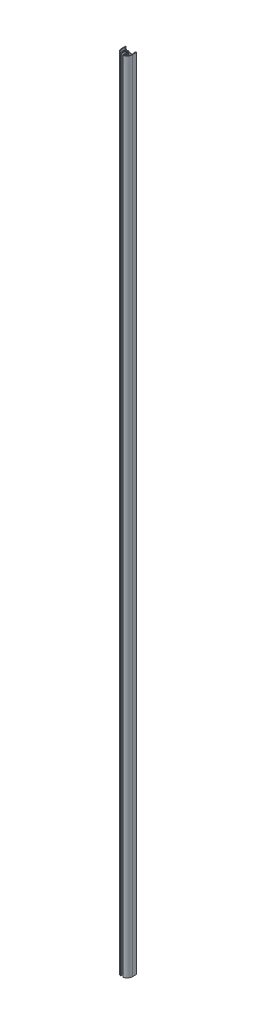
ISO-10303-21;
HEADER;
FILE_DESCRIPTION(('STEP AP214'),'2;1');
FILE_NAME('part.step','',(''),(''),'','','');
FILE_SCHEMA(('AUTOMOTIVE_DESIGN { 1 0 10303 214 1 1 1 1 }'));
ENDSEC;
DATA;
#1=APPLICATION_CONTEXT('core data for automotive mechanical design processes');
#2=APPLICATION_PROTOCOL_DEFINITION('international standard','automotive_design',2000,#1);
#3=PRODUCT_CONTEXT('',#1,'mechanical');
#4=PRODUCT('Part','Part','',(#3));
#5=PRODUCT_RELATED_PRODUCT_CATEGORY('part','',(#4));
#6=PRODUCT_DEFINITION_FORMATION('','',#4);
#7=PRODUCT_DEFINITION_CONTEXT('part definition',#1,'design');
#8=PRODUCT_DEFINITION('design','',#6,#7);
#9=PRODUCT_DEFINITION_SHAPE('','',#8);
#10=(LENGTH_UNIT() NAMED_UNIT(*) SI_UNIT(.MILLI.,.METRE.));
#11=(NAMED_UNIT(*) PLANE_ANGLE_UNIT() SI_UNIT($,.RADIAN.));
#12=(NAMED_UNIT(*) SI_UNIT($,.STERADIAN.) SOLID_ANGLE_UNIT());
#13=UNCERTAINTY_MEASURE_WITH_UNIT(LENGTH_MEASURE(1.E-05),#10,'distance_accuracy_value','');
#14=(GEOMETRIC_REPRESENTATION_CONTEXT(3) GLOBAL_UNCERTAINTY_ASSIGNED_CONTEXT((#13)) GLOBAL_UNIT_ASSIGNED_CONTEXT((#10,
#11,#12)) REPRESENTATION_CONTEXT('',''));
#15=CARTESIAN_POINT('',(0.,0.,0.));
#16=DIRECTION('',(0.,0.,1.));
#17=DIRECTION('',(1.,0.,0.));
#18=AXIS2_PLACEMENT_3D('',#15,#16,#17);
#19=CARTESIAN_POINT('',(1.19993037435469,-2200.,-3.67456081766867));
#20=DIRECTION('',(0.,0.,1.));
#21=DIRECTION('',(1.,0.,0.));
#22=AXIS2_PLACEMENT_3D('',#19,#20,#21);
#23=PLANE('',#22);
#24=DIRECTION('',(1.,0.,0.));
#25=VECTOR('',#24,1.);
#26=CARTESIAN_POINT('',(1.19993037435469,0.,-3.67456081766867));
#27=LINE('',#26,#25);
#28=CARTESIAN_POINT('',(-1.20006962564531,0.,-3.67456081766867));
#29=VERTEX_POINT('',#28);
#30=CARTESIAN_POINT('',(1.19993037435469,0.,-3.67456081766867));
#31=VERTEX_POINT('',#30);
#32=EDGE_CURVE('E664',#29,#31,#27,.T.);
#33=ORIENTED_EDGE('',*,*,#32,.F.);
#34=DIRECTION('',(0.,1.,0.));
#35=VECTOR('',#34,1.);
#36=CARTESIAN_POINT('',(-1.20006962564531,-2200.,-3.67456081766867));
#37=LINE('',#36,#35);
#38=CARTESIAN_POINT('',(-1.20006962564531,-2200.,-3.67456081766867));
#39=VERTEX_POINT('',#38);
#40=EDGE_CURVE('E11',#39,#29,#37,.T.);
#41=ORIENTED_EDGE('',*,*,#40,.F.);
#42=DIRECTION('',(1.,0.,0.));
#43=VECTOR('',#42,1.);
#44=CARTESIAN_POINT('',(1.19993037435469,-2200.,-3.67456081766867));
#45=LINE('',#44,#43);
#46=CARTESIAN_POINT('',(1.19993037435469,-2200.,-3.67456081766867));
#47=VERTEX_POINT('',#46);
#48=EDGE_CURVE('E695',#39,#47,#45,.T.);
#49=ORIENTED_EDGE('',*,*,#48,.T.);
#50=DIRECTION('',(0.,1.,0.));
#51=VECTOR('',#50,1.);
#52=CARTESIAN_POINT('',(1.19993037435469,-2200.,-3.67456081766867));
#53=LINE('',#52,#51);
#54=EDGE_CURVE('E36',#47,#31,#53,.T.);
#55=ORIENTED_EDGE('',*,*,#54,.T.);
#56=EDGE_LOOP('',(#33,#41,#49,#55));
#57=FACE_BOUND('',#56,.T.);
#58=ADVANCED_FACE('F33',(#57),#23,.T.);
#59=CARTESIAN_POINT('',(-1.20006962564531,-2200.,-3.67456081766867));
#60=DIRECTION('',(1.,0.,0.));
#61=DIRECTION('',(0.,0.,-1.));
#62=AXIS2_PLACEMENT_3D('',#59,#60,#61);
#63=PLANE('',#62);
#64=DIRECTION('',(0.,0.,-1.));
#65=VECTOR('',#64,1.);
#66=CARTESIAN_POINT('',(-1.20006962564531,0.,-3.67456081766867));
#67=LINE('',#66,#65);
#68=CARTESIAN_POINT('',(-1.20006962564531,0.,-1.27456081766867));
#69=VERTEX_POINT('',#68);
#70=EDGE_CURVE('E699',#69,#29,#67,.T.);
#71=ORIENTED_EDGE('',*,*,#70,.F.);
#72=DIRECTION('',(0.,1.,0.));
#73=VECTOR('',#72,1.);
#74=CARTESIAN_POINT('',(-1.20006962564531,-2200.,-1.27456081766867));
#75=LINE('',#74,#73);
#76=CARTESIAN_POINT('',(-1.20006962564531,-2200.,-1.27456081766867));
#77=VERTEX_POINT('',#76);
#78=EDGE_CURVE('E41',#77,#69,#75,.T.);
#79=ORIENTED_EDGE('',*,*,#78,.F.);
#80=DIRECTION('',(0.,0.,-1.));
#81=VECTOR('',#80,1.);
#82=CARTESIAN_POINT('',(-1.20006962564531,-2200.,-3.67456081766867));
#83=LINE('',#82,#81);
#84=EDGE_CURVE('E810',#77,#39,#83,.T.);
#85=ORIENTED_EDGE('',*,*,#84,.T.);
#86=ORIENTED_EDGE('',*,*,#40,.T.);
#87=EDGE_LOOP('',(#71,#79,#85,#86));
#88=FACE_BOUND('',#87,.T.);
#89=ADVANCED_FACE('F1012',(#88),#63,.T.);
#90=CARTESIAN_POINT('',(-1.20006962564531,-2200.,-1.27456081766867));
#91=DIRECTION('',(0.,0.,1.));
#92=DIRECTION('',(1.,0.,0.));
#93=AXIS2_PLACEMENT_3D('',#90,#91,#92);
#94=PLANE('',#93);
#95=DIRECTION('',(1.,0.,0.));
#96=VECTOR('',#95,1.);
#97=CARTESIAN_POINT('',(-1.20006962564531,0.,-1.27456081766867));
#98=LINE('',#97,#96);
#99=CARTESIAN_POINT('',(-3.00006962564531,0.,-1.27456081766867));
#100=VERTEX_POINT('',#99);
#101=EDGE_CURVE('E923',#100,#69,#98,.T.);
#102=ORIENTED_EDGE('',*,*,#101,.F.);
#103=DIRECTION('',(0.,1.,0.));
#104=VECTOR('',#103,1.);
#105=CARTESIAN_POINT('',(-3.00006962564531,-2200.,-1.27456081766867));
#106=LINE('',#105,#104);
#107=CARTESIAN_POINT('',(-3.00006962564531,-2200.,-1.27456081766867));
#108=VERTEX_POINT('',#107);
#109=EDGE_CURVE('E929',#108,#100,#106,.T.);
#110=ORIENTED_EDGE('',*,*,#109,.F.);
#111=DIRECTION('',(1.,0.,0.));
#112=VECTOR('',#111,1.);
#113=CARTESIAN_POINT('',(-1.20006962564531,-2200.,-1.27456081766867));
#114=LINE('',#113,#112);
#115=EDGE_CURVE('E807',#108,#77,#114,.T.);
#116=ORIENTED_EDGE('',*,*,#115,.T.);
#117=ORIENTED_EDGE('',*,*,#78,.T.);
#118=EDGE_LOOP('',(#102,#110,#116,#117));
#119=FACE_BOUND('',#118,.T.);
#120=ADVANCED_FACE('F1156',(#119),#94,.T.);
#121=CARTESIAN_POINT('',(-3.00006962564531,-2200.,-1.27456081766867));
#122=DIRECTION('',(1.,0.,0.));
#123=DIRECTION('',(0.,0.,-1.));
#124=AXIS2_PLACEMENT_3D('',#121,#122,#123);
#125=PLANE('',#124);
#126=DIRECTION('',(0.,0.,-1.));
#127=VECTOR('',#126,1.);
#128=CARTESIAN_POINT('',(-3.00006962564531,0.,-1.27456081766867));
#129=LINE('',#128,#127);
#130=CARTESIAN_POINT('',(-3.00006962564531,0.,2.27543918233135));
#131=VERTEX_POINT('',#130);
#132=EDGE_CURVE('E920',#131,#100,#129,.T.);
#133=ORIENTED_EDGE('',*,*,#132,.F.);
#134=DIRECTION('',(0.,1.,0.));
#135=VECTOR('',#134,1.);
#136=CARTESIAN_POINT('',(-3.00006962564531,-2200.,2.27543918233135));
#137=LINE('',#136,#135);
#138=CARTESIAN_POINT('',(-3.00006962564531,-2200.,2.27543918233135));
#139=VERTEX_POINT('',#138);
#140=EDGE_CURVE('E931',#139,#131,#137,.T.);
#141=ORIENTED_EDGE('',*,*,#140,.F.);
#142=DIRECTION('',(0.,0.,-1.));
#143=VECTOR('',#142,1.);
#144=CARTESIAN_POINT('',(-3.00006962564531,-2200.,-1.27456081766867));
#145=LINE('',#144,#143);
#146=EDGE_CURVE('E804',#139,#108,#145,.T.);
#147=ORIENTED_EDGE('',*,*,#146,.T.);
#148=ORIENTED_EDGE('',*,*,#109,.T.);
#149=EDGE_LOOP('',(#133,#141,#147,#148));
#150=FACE_BOUND('',#149,.T.);
#151=ADVANCED_FACE('F1153',(#150),#125,.T.);
#152=CARTESIAN_POINT('',(-3.00006962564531,-2200.,2.27543918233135));
#153=DIRECTION('',(0.707106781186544,0.,0.707106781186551));
#154=DIRECTION('',(0.707106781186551,0.,-0.707106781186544));
#155=AXIS2_PLACEMENT_3D('',#152,#153,#154);
#156=PLANE('',#155);
#157=DIRECTION('',(0.707106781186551,0.,-0.707106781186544));
#158=VECTOR('',#157,1.);
#159=CARTESIAN_POINT('',(-3.00006962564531,0.,2.27543918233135));
#160=LINE('',#159,#158);
#161=CARTESIAN_POINT('',(-3.2500696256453,0.,2.52543918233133));
#162=VERTEX_POINT('',#161);
#163=EDGE_CURVE('E917',#162,#131,#160,.T.);
#164=ORIENTED_EDGE('',*,*,#163,.F.);
#165=DIRECTION('',(0.,1.,0.));
#166=VECTOR('',#165,1.);
#167=CARTESIAN_POINT('',(-3.2500696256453,-2200.,2.52543918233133));
#168=LINE('',#167,#166);
#169=CARTESIAN_POINT('',(-3.2500696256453,-2200.,2.52543918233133));
#170=VERTEX_POINT('',#169);
#171=EDGE_CURVE('E933',#170,#162,#168,.T.);
#172=ORIENTED_EDGE('',*,*,#171,.F.);
#173=DIRECTION('',(0.707106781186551,0.,-0.707106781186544));
#174=VECTOR('',#173,1.);
#175=CARTESIAN_POINT('',(-3.00006962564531,-2200.,2.27543918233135));
#176=LINE('',#175,#174);
#177=EDGE_CURVE('E801',#170,#139,#176,.T.);
#178=ORIENTED_EDGE('',*,*,#177,.T.);
#179=ORIENTED_EDGE('',*,*,#140,.T.);
#180=EDGE_LOOP('',(#164,#172,#178,#179));
#181=FACE_BOUND('',#180,.T.);
#182=ADVANCED_FACE('F1150',(#181),#156,.T.);
#183=CARTESIAN_POINT('',(-3.2500696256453,-2200.,2.52543918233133));
#184=DIRECTION('',(0.,0.,1.));
#185=DIRECTION('',(1.,0.,0.));
#186=AXIS2_PLACEMENT_3D('',#183,#184,#185);
#187=PLANE('',#186);
#188=DIRECTION('',(1.,0.,0.));
#189=VECTOR('',#188,1.);
#190=CARTESIAN_POINT('',(-3.2500696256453,0.,2.52543918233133));
#191=LINE('',#190,#189);
#192=CARTESIAN_POINT('',(-3.30006962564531,0.,2.52543918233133));
#193=VERTEX_POINT('',#192);
#194=EDGE_CURVE('E914',#193,#162,#191,.T.);
#195=ORIENTED_EDGE('',*,*,#194,.F.);
#196=DIRECTION('',(0.,1.,0.));
#197=VECTOR('',#196,1.);
#198=CARTESIAN_POINT('',(-3.30006962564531,-2200.,2.52543918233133));
#199=LINE('',#198,#197);
#200=CARTESIAN_POINT('',(-3.30006962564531,-2200.,2.52543918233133));
#201=VERTEX_POINT('',#200);
#202=EDGE_CURVE('E935',#201,#193,#199,.T.);
#203=ORIENTED_EDGE('',*,*,#202,.F.);
#204=DIRECTION('',(1.,0.,0.));
#205=VECTOR('',#204,1.);
#206=CARTESIAN_POINT('',(-3.2500696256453,-2200.,2.52543918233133));
#207=LINE('',#206,#205);
#208=EDGE_CURVE('E798',#201,#170,#207,.T.);
#209=ORIENTED_EDGE('',*,*,#208,.T.);
#210=ORIENTED_EDGE('',*,*,#171,.T.);
#211=EDGE_LOOP('',(#195,#203,#209,#210));
#212=FACE_BOUND('',#211,.T.);
#213=ADVANCED_FACE('F1146',(#212),#187,.T.);
#214=CARTESIAN_POINT('',(-3.30006962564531,-2200.,2.52543918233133));
#215=DIRECTION('',(1.,0.,0.));
#216=DIRECTION('',(0.,0.,-1.));
#217=AXIS2_PLACEMENT_3D('',#214,#215,#216);
#218=PLANE('',#217);
#219=DIRECTION('',(0.,0.,-1.));
#220=VECTOR('',#219,1.);
#221=CARTESIAN_POINT('',(-3.30006962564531,0.,2.52543918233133));
#222=LINE('',#221,#220);
#223=CARTESIAN_POINT('',(-3.30006962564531,0.,9.02543918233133));
#224=VERTEX_POINT('',#223);
#225=EDGE_CURVE('E911',#224,#193,#222,.T.);
#226=ORIENTED_EDGE('',*,*,#225,.F.);
#227=DIRECTION('',(0.,1.,0.));
#228=VECTOR('',#227,1.);
#229=CARTESIAN_POINT('',(-3.30006962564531,-2200.,9.02543918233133));
#230=LINE('',#229,#228);
#231=CARTESIAN_POINT('',(-3.30006962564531,-2200.,9.02543918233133));
#232=VERTEX_POINT('',#231);
#233=EDGE_CURVE('E937',#232,#224,#230,.T.);
#234=ORIENTED_EDGE('',*,*,#233,.F.);
#235=DIRECTION('',(0.,0.,-1.));
#236=VECTOR('',#235,1.);
#237=CARTESIAN_POINT('',(-3.30006962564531,-2200.,2.52543918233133));
#238=LINE('',#237,#236);
#239=EDGE_CURVE('E795',#232,#201,#238,.T.);
#240=ORIENTED_EDGE('',*,*,#239,.T.);
#241=ORIENTED_EDGE('',*,*,#202,.T.);
#242=EDGE_LOOP('',(#226,#234,#240,#241));
#243=FACE_BOUND('',#242,.T.);
#244=ADVANCED_FACE('F1142',(#243),#218,.T.);
#245=CARTESIAN_POINT('',(-3.30006962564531,-2200.,9.02543918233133));
#246=DIRECTION('',(0.,0.,-1.));
#247=DIRECTION('',(-1.,0.,0.));
#248=AXIS2_PLACEMENT_3D('',#245,#246,#247);
#249=PLANE('',#248);
#250=DIRECTION('',(-1.,0.,0.));
#251=VECTOR('',#250,1.);
#252=CARTESIAN_POINT('',(-3.30006962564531,0.,9.02543918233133));
#253=LINE('',#252,#251);
#254=CARTESIAN_POINT('',(-3.20006962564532,0.,9.02543918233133));
#255=VERTEX_POINT('',#254);
#256=EDGE_CURVE('E908',#255,#224,#253,.T.);
#257=ORIENTED_EDGE('',*,*,#256,.F.);
#258=DIRECTION('',(0.,1.,0.));
#259=VECTOR('',#258,1.);
#260=CARTESIAN_POINT('',(-3.20006962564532,-2200.,9.02543918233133));
#261=LINE('',#260,#259);
#262=CARTESIAN_POINT('',(-3.20006962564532,-2200.,9.02543918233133));
#263=VERTEX_POINT('',#262);
#264=EDGE_CURVE('E939',#263,#255,#261,.T.);
#265=ORIENTED_EDGE('',*,*,#264,.F.);
#266=DIRECTION('',(-1.,0.,0.));
#267=VECTOR('',#266,1.);
#268=CARTESIAN_POINT('',(-3.30006962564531,-2200.,9.02543918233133));
#269=LINE('',#268,#267);
#270=EDGE_CURVE('E792',#263,#232,#269,.T.);
#271=ORIENTED_EDGE('',*,*,#270,.T.);
#272=ORIENTED_EDGE('',*,*,#233,.T.);
#273=EDGE_LOOP('',(#257,#265,#271,#272));
#274=FACE_BOUND('',#273,.T.);
#275=ADVANCED_FACE('F1138',(#274),#249,.T.);
#276=CARTESIAN_POINT('',(-3.20006962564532,-2200.,9.02543918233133));
#277=DIRECTION('',(0.707106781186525,0.,-0.70710678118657));
#278=DIRECTION('',(-0.70710678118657,0.,-0.707106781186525));
#279=AXIS2_PLACEMENT_3D('',#276,#277,#278);
#280=PLANE('',#279);
#281=DIRECTION('',(-0.70710678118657,0.,-0.707106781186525));
#282=VECTOR('',#281,1.);
#283=CARTESIAN_POINT('',(-3.20006962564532,0.,9.02543918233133));
#284=LINE('',#283,#282);
#285=CARTESIAN_POINT('',(-2.95006962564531,0.,9.27543918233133));
#286=VERTEX_POINT('',#285);
#287=EDGE_CURVE('E905',#286,#255,#284,.T.);
#288=ORIENTED_EDGE('',*,*,#287,.F.);
#289=DIRECTION('',(0.,1.,0.));
#290=VECTOR('',#289,1.);
#291=CARTESIAN_POINT('',(-2.95006962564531,-2200.,9.27543918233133));
#292=LINE('',#291,#290);
#293=CARTESIAN_POINT('',(-2.95006962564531,-2200.,9.27543918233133));
#294=VERTEX_POINT('',#293);
#295=EDGE_CURVE('E941',#294,#286,#292,.T.);
#296=ORIENTED_EDGE('',*,*,#295,.F.);
#297=DIRECTION('',(-0.70710678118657,0.,-0.707106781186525));
#298=VECTOR('',#297,1.);
#299=CARTESIAN_POINT('',(-3.20006962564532,-2200.,9.02543918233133));
#300=LINE('',#299,#298);
#301=EDGE_CURVE('E789',#294,#263,#300,.T.);
#302=ORIENTED_EDGE('',*,*,#301,.T.);
#303=ORIENTED_EDGE('',*,*,#264,.T.);
#304=EDGE_LOOP('',(#288,#296,#302,#303));
#305=FACE_BOUND('',#304,.T.);
#306=ADVANCED_FACE('F1134',(#305),#280,.T.);
#307=CARTESIAN_POINT('',(-2.95006962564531,-2200.,9.27543918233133));
#308=DIRECTION('',(1.,0.,0.));
#309=DIRECTION('',(0.,0.,-1.));
#310=AXIS2_PLACEMENT_3D('',#307,#308,#309);
#311=PLANE('',#310);
#312=DIRECTION('',(0.,0.,-1.));
#313=VECTOR('',#312,1.);
#314=CARTESIAN_POINT('',(-2.95006962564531,0.,9.27543918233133));
#315=LINE('',#314,#313);
#316=CARTESIAN_POINT('',(-2.95006962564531,0.,12.6090289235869));
#317=VERTEX_POINT('',#316);
#318=EDGE_CURVE('E902',#317,#286,#315,.T.);
#319=ORIENTED_EDGE('',*,*,#318,.F.);
#320=DIRECTION('',(0.,1.,0.));
#321=VECTOR('',#320,1.);
#322=CARTESIAN_POINT('',(-2.95006962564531,-2200.,12.6090289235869));
#323=LINE('',#322,#321);
#324=CARTESIAN_POINT('',(-2.95006962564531,-2200.,12.6090289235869));
#325=VERTEX_POINT('',#324);
#326=EDGE_CURVE('E943',#325,#317,#323,.T.);
#327=ORIENTED_EDGE('',*,*,#326,.F.);
#328=DIRECTION('',(0.,0.,-1.));
#329=VECTOR('',#328,1.);
#330=CARTESIAN_POINT('',(-2.95006962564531,-2200.,9.27543918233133));
#331=LINE('',#330,#329);
#332=EDGE_CURVE('E786',#325,#294,#331,.T.);
#333=ORIENTED_EDGE('',*,*,#332,.T.);
#334=ORIENTED_EDGE('',*,*,#295,.T.);
#335=EDGE_LOOP('',(#319,#327,#333,#334));
#336=FACE_BOUND('',#335,.T.);
#337=ADVANCED_FACE('F1130',(#336),#311,.T.);
#338=CARTESIAN_POINT('',(-3.45006962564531,-2200.,12.6090289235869));
#339=DIRECTION('',(0.,1.,0.));
#340=DIRECTION('',(0.,0.,1.));
#341=AXIS2_PLACEMENT_3D('',#338,#339,#340);
#342=CYLINDRICAL_SURFACE('',#341,0.500000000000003);
#343=CARTESIAN_POINT('',(-3.45006962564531,0.,12.6090289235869));
#344=DIRECTION('',(0.,1.,0.));
#345=DIRECTION('',(0.,0.,-1.));
#346=AXIS2_PLACEMENT_3D('',#343,#344,#345);
#347=CIRCLE('',#346,0.500000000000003);
#348=CARTESIAN_POINT('',(-3.58305246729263,0.,13.0910201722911));
#349=VERTEX_POINT('',#348);
#350=EDGE_CURVE('E899',#349,#317,#347,.T.);
#351=ORIENTED_EDGE('',*,*,#350,.F.);
#352=DIRECTION('',(0.,1.,0.));
#353=VECTOR('',#352,1.);
#354=CARTESIAN_POINT('',(-3.58305246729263,-2200.,13.0910201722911));
#355=LINE('',#354,#353);
#356=CARTESIAN_POINT('',(-3.58305246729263,-2200.,13.0910201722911));
#357=VERTEX_POINT('',#356);
#358=EDGE_CURVE('E945',#357,#349,#355,.T.);
#359=ORIENTED_EDGE('',*,*,#358,.F.);
#360=CARTESIAN_POINT('',(-3.45006962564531,-2200.,12.6090289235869));
#361=DIRECTION('',(0.,1.,0.));
#362=DIRECTION('',(0.,0.,-1.));
#363=AXIS2_PLACEMENT_3D('',#360,#361,#362);
#364=CIRCLE('',#363,0.500000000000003);
#365=EDGE_CURVE('E783',#357,#325,#364,.T.);
#366=ORIENTED_EDGE('',*,*,#365,.T.);
#367=ORIENTED_EDGE('',*,*,#326,.T.);
#368=EDGE_LOOP('',(#351,#359,#366,#367));
#369=FACE_BOUND('',#368,.T.);
#370=ADVANCED_FACE('F1126',(#369),#342,.T.);
#371=CARTESIAN_POINT('',(0.27268194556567,-2200.,-1.68856200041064));
#372=DIRECTION('',(0.,1.,0.));
#373=DIRECTION('',(0.,0.,1.));
#374=AXIS2_PLACEMENT_3D('',#371,#372,#373);
#375=CYLINDRICAL_SURFACE('',#374,15.2742507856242);
#376=CARTESIAN_POINT('',(0.27268194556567,0.,-1.68856200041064));
#377=DIRECTION('',(0.,1.,0.));
#378=DIRECTION('',(0.,0.,-1.));
#379=AXIS2_PLACEMENT_3D('',#376,#377,#378);
#380=CIRCLE('',#379,15.2742507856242);
#381=CARTESIAN_POINT('',(-15.0000696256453,0.,-1.47456081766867));
#382=VERTEX_POINT('',#381);
#383=EDGE_CURVE('E896',#382,#349,#380,.T.);
#384=ORIENTED_EDGE('',*,*,#383,.F.);
#385=DIRECTION('',(0.,1.,0.));
#386=VECTOR('',#385,1.);
#387=CARTESIAN_POINT('',(-15.0000696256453,-2200.,-1.47456081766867));
#388=LINE('',#387,#386);
#389=CARTESIAN_POINT('',(-15.0000696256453,-2200.,-1.47456081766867));
#390=VERTEX_POINT('',#389);
#391=EDGE_CURVE('E947',#390,#382,#388,.T.);
#392=ORIENTED_EDGE('',*,*,#391,.F.);
#393=CARTESIAN_POINT('',(0.27268194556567,-2200.,-1.68856200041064));
#394=DIRECTION('',(0.,1.,0.));
#395=DIRECTION('',(0.,0.,-1.));
#396=AXIS2_PLACEMENT_3D('',#393,#394,#395);
#397=CIRCLE('',#396,15.2742507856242);
#398=EDGE_CURVE('E780',#390,#357,#397,.T.);
#399=ORIENTED_EDGE('',*,*,#398,.T.);
#400=ORIENTED_EDGE('',*,*,#358,.T.);
#401=EDGE_LOOP('',(#384,#392,#399,#400));
#402=FACE_BOUND('',#401,.T.);
#403=ADVANCED_FACE('F1122',(#402),#375,.T.);
#404=CARTESIAN_POINT('',(-15.0000696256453,-2200.,-1.47456081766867));
#405=DIRECTION('',(-1.,0.,0.));
#406=DIRECTION('',(0.,0.,1.));
#407=AXIS2_PLACEMENT_3D('',#404,#405,#406);
#408=PLANE('',#407);
#409=DIRECTION('',(0.,0.,1.));
#410=VECTOR('',#409,1.);
#411=CARTESIAN_POINT('',(-15.0000696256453,0.,-1.47456081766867));
#412=LINE('',#411,#410);
#413=CARTESIAN_POINT('',(-15.0000696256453,0.,-12.6004411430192));
#414=VERTEX_POINT('',#413);
#415=EDGE_CURVE('E893',#414,#382,#412,.T.);
#416=ORIENTED_EDGE('',*,*,#415,.F.);
#417=DIRECTION('',(0.,1.,0.));
#418=VECTOR('',#417,1.);
#419=CARTESIAN_POINT('',(-15.0000696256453,-2200.,-12.6004411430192));
#420=LINE('',#419,#418);
#421=CARTESIAN_POINT('',(-15.0000696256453,-2200.,-12.6004411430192));
#422=VERTEX_POINT('',#421);
#423=EDGE_CURVE('E949',#422,#414,#420,.T.);
#424=ORIENTED_EDGE('',*,*,#423,.F.);
#425=DIRECTION('',(0.,0.,1.));
#426=VECTOR('',#425,1.);
#427=CARTESIAN_POINT('',(-15.0000696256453,-2200.,-1.47456081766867));
#428=LINE('',#427,#426);
#429=EDGE_CURVE('E777',#422,#390,#428,.T.);
#430=ORIENTED_EDGE('',*,*,#429,.T.);
#431=ORIENTED_EDGE('',*,*,#391,.T.);
#432=EDGE_LOOP('',(#416,#424,#430,#431));
#433=FACE_BOUND('',#432,.T.);
#434=ADVANCED_FACE('F1118',(#433),#408,.T.);
#435=CARTESIAN_POINT('',(-14.5000696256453,-2200.,-12.6004411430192));
#436=DIRECTION('',(0.,1.,0.));
#437=DIRECTION('',(0.,0.,1.));
#438=AXIS2_PLACEMENT_3D('',#435,#436,#437);
#439=CYLINDRICAL_SURFACE('',#438,0.500000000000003);
#440=CARTESIAN_POINT('',(-14.5000696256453,0.,-12.6004411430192));
#441=DIRECTION('',(0.,1.,0.));
#442=DIRECTION('',(0.,0.,-1.));
#443=AXIS2_PLACEMENT_3D('',#440,#441,#442);
#444=CIRCLE('',#443,0.500000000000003);
#445=CARTESIAN_POINT('',(-14.07359903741,0.,-12.8614446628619));
#446=VERTEX_POINT('',#445);
#447=EDGE_CURVE('E890',#446,#414,#444,.T.);
#448=ORIENTED_EDGE('',*,*,#447,.F.);
#449=DIRECTION('',(0.,1.,0.));
#450=VECTOR('',#449,1.);
#451=CARTESIAN_POINT('',(-14.07359903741,-2200.,-12.8614446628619));
#452=LINE('',#451,#450);
#453=CARTESIAN_POINT('',(-14.07359903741,-2200.,-12.8614446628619));
#454=VERTEX_POINT('',#453);
#455=EDGE_CURVE('E951',#454,#446,#452,.T.);
#456=ORIENTED_EDGE('',*,*,#455,.F.);
#457=CARTESIAN_POINT('',(-14.5000696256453,-2200.,-12.6004411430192));
#458=DIRECTION('',(0.,1.,0.));
#459=DIRECTION('',(0.,0.,-1.));
#460=AXIS2_PLACEMENT_3D('',#457,#458,#459);
#461=CIRCLE('',#460,0.500000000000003);
#462=EDGE_CURVE('E774',#454,#422,#461,.T.);
#463=ORIENTED_EDGE('',*,*,#462,.T.);
#464=ORIENTED_EDGE('',*,*,#423,.T.);
#465=EDGE_LOOP('',(#448,#456,#463,#464));
#466=FACE_BOUND('',#465,.T.);
#467=ADVANCED_FACE('F1114',(#466),#439,.T.);
#468=CARTESIAN_POINT('',(-6.96256453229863E-05,-2200.,-21.4745608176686));
#469=DIRECTION('',(0.,1.,0.));
#470=DIRECTION('',(0.,0.,1.));
#471=AXIS2_PLACEMENT_3D('',#468,#469,#470);
#472=CYLINDRICAL_SURFACE('',#471,16.5);
#473=CARTESIAN_POINT('',(-6.96256453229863E-05,0.,-21.4745608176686));
#474=DIRECTION('',(0.,-1.,0.));
#475=DIRECTION('',(0.,0.,1.));
#476=AXIS2_PLACEMENT_3D('',#473,#474,#475);
#477=CIRCLE('',#476,16.5);
#478=CARTESIAN_POINT('',(-5.40006962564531,0.,-5.88321706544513));
#479=VERTEX_POINT('',#478);
#480=EDGE_CURVE('E887',#479,#446,#477,.T.);
#481=ORIENTED_EDGE('',*,*,#480,.F.);
#482=DIRECTION('',(0.,1.,0.));
#483=VECTOR('',#482,1.);
#484=CARTESIAN_POINT('',(-5.40006962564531,-2200.,-5.88321706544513));
#485=LINE('',#484,#483);
#486=CARTESIAN_POINT('',(-5.40006962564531,-2200.,-5.88321706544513));
#487=VERTEX_POINT('',#486);
#488=EDGE_CURVE('E953',#487,#479,#485,.T.);
#489=ORIENTED_EDGE('',*,*,#488,.F.);
#490=CARTESIAN_POINT('',(-6.96256453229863E-05,-2200.,-21.4745608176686));
#491=DIRECTION('',(0.,-1.,0.));
#492=DIRECTION('',(0.,0.,1.));
#493=AXIS2_PLACEMENT_3D('',#490,#491,#492);
#494=CIRCLE('',#493,16.5);
#495=EDGE_CURVE('E771',#487,#454,#494,.T.);
#496=ORIENTED_EDGE('',*,*,#495,.T.);
#497=ORIENTED_EDGE('',*,*,#455,.T.);
#498=EDGE_LOOP('',(#481,#489,#496,#497));
#499=FACE_BOUND('',#498,.T.);
#500=ADVANCED_FACE('F1110',(#499),#472,.F.);
#501=CARTESIAN_POINT('',(-5.40006962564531,-2200.,-5.88321706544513));
#502=DIRECTION('',(1.,0.,0.));
#503=DIRECTION('',(0.,0.,-1.));
#504=AXIS2_PLACEMENT_3D('',#501,#502,#503);
#505=PLANE('',#504);
#506=DIRECTION('',(0.,0.,-1.));
#507=VECTOR('',#506,1.);
#508=CARTESIAN_POINT('',(-5.40006962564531,0.,-5.88321706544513));
#509=LINE('',#508,#507);
#510=CARTESIAN_POINT('',(-5.40006962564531,0.,-2.47456081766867));
#511=VERTEX_POINT('',#510);
#512=EDGE_CURVE('E884',#511,#479,#509,.T.);
#513=ORIENTED_EDGE('',*,*,#512,.F.);
#514=DIRECTION('',(0.,1.,0.));
#515=VECTOR('',#514,1.);
#516=CARTESIAN_POINT('',(-5.40006962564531,-2200.,-2.47456081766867));
#517=LINE('',#516,#515);
#518=CARTESIAN_POINT('',(-5.40006962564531,-2200.,-2.47456081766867));
#519=VERTEX_POINT('',#518);
#520=EDGE_CURVE('E955',#519,#511,#517,.T.);
#521=ORIENTED_EDGE('',*,*,#520,.F.);
#522=DIRECTION('',(0.,0.,-1.));
#523=VECTOR('',#522,1.);
#524=CARTESIAN_POINT('',(-5.40006962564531,-2200.,-5.88321706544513));
#525=LINE('',#524,#523);
#526=EDGE_CURVE('E768',#519,#487,#525,.T.);
#527=ORIENTED_EDGE('',*,*,#526,.T.);
#528=ORIENTED_EDGE('',*,*,#488,.T.);
#529=EDGE_LOOP('',(#513,#521,#527,#528));
#530=FACE_BOUND('',#529,.T.);
#531=ADVANCED_FACE('F1106',(#530),#505,.T.);
#532=CARTESIAN_POINT('',(-5.40006962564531,-2200.,-2.47456081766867));
#533=DIRECTION('',(0.,0.,-1.));
#534=DIRECTION('',(-1.,0.,0.));
#535=AXIS2_PLACEMENT_3D('',#532,#533,#534);
#536=PLANE('',#535);
#537=DIRECTION('',(-1.,0.,0.));
#538=VECTOR('',#537,1.);
#539=CARTESIAN_POINT('',(-5.40006962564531,0.,-2.47456081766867));
#540=LINE('',#539,#538);
#541=CARTESIAN_POINT('',(-2.40006962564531,0.,-2.47456081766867));
#542=VERTEX_POINT('',#541);
#543=EDGE_CURVE('E881',#542,#511,#540,.T.);
#544=ORIENTED_EDGE('',*,*,#543,.F.);
#545=DIRECTION('',(0.,1.,0.));
#546=VECTOR('',#545,1.);
#547=CARTESIAN_POINT('',(-2.40006962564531,-2200.,-2.47456081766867));
#548=LINE('',#547,#546);
#549=CARTESIAN_POINT('',(-2.40006962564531,-2200.,-2.47456081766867));
#550=VERTEX_POINT('',#549);
#551=EDGE_CURVE('E957',#550,#542,#548,.T.);
#552=ORIENTED_EDGE('',*,*,#551,.F.);
#553=DIRECTION('',(-1.,0.,0.));
#554=VECTOR('',#553,1.);
#555=CARTESIAN_POINT('',(-5.40006962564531,-2200.,-2.47456081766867));
#556=LINE('',#555,#554);
#557=EDGE_CURVE('E765',#550,#519,#556,.T.);
#558=ORIENTED_EDGE('',*,*,#557,.T.);
#559=ORIENTED_EDGE('',*,*,#520,.T.);
#560=EDGE_LOOP('',(#544,#552,#558,#559));
#561=FACE_BOUND('',#560,.T.);
#562=ADVANCED_FACE('F1102',(#561),#536,.T.);
#563=CARTESIAN_POINT('',(-2.40006962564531,-2200.,-2.47456081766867));
#564=DIRECTION('',(-1.,0.,0.));
#565=DIRECTION('',(0.,0.,1.));
#566=AXIS2_PLACEMENT_3D('',#563,#564,#565);
#567=PLANE('',#566);
#568=DIRECTION('',(0.,0.,1.));
#569=VECTOR('',#568,1.);
#570=CARTESIAN_POINT('',(-2.40006962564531,0.,-2.47456081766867));
#571=LINE('',#570,#569);
#572=CARTESIAN_POINT('',(-2.40006962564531,0.,-4.58107094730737));
#573=VERTEX_POINT('',#572);
#574=EDGE_CURVE('E878',#573,#542,#571,.T.);
#575=ORIENTED_EDGE('',*,*,#574,.F.);
#576=DIRECTION('',(0.,1.,0.));
#577=VECTOR('',#576,1.);
#578=CARTESIAN_POINT('',(-2.40006962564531,-2200.,-4.58107094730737));
#579=LINE('',#578,#577);
#580=CARTESIAN_POINT('',(-2.40006962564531,-2200.,-4.58107094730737));
#581=VERTEX_POINT('',#580);
#582=EDGE_CURVE('E959',#581,#573,#579,.T.);
#583=ORIENTED_EDGE('',*,*,#582,.F.);
#584=DIRECTION('',(0.,0.,1.));
#585=VECTOR('',#584,1.);
#586=CARTESIAN_POINT('',(-2.40006962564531,-2200.,-2.47456081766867));
#587=LINE('',#586,#585);
#588=EDGE_CURVE('E762',#581,#550,#587,.T.);
#589=ORIENTED_EDGE('',*,*,#588,.T.);
#590=ORIENTED_EDGE('',*,*,#551,.T.);
#591=EDGE_LOOP('',(#575,#583,#589,#590));
#592=FACE_BOUND('',#591,.T.);
#593=ADVANCED_FACE('F1098',(#592),#567,.T.);
#594=CARTESIAN_POINT('',(-1.90006962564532,-2200.,-4.58107094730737));
#595=DIRECTION('',(0.,1.,0.));
#596=DIRECTION('',(0.,0.,1.));
#597=AXIS2_PLACEMENT_3D('',#594,#595,#596);
#598=CYLINDRICAL_SURFACE('',#597,0.499999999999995);
#599=CARTESIAN_POINT('',(-1.90006962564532,0.,-4.58107094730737));
#600=DIRECTION('',(0.,1.,0.));
#601=DIRECTION('',(0.,0.,-1.));
#602=AXIS2_PLACEMENT_3D('',#599,#600,#601);
#603=CIRCLE('',#602,0.499999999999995);
#604=CARTESIAN_POINT('',(-1.84418727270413,0.,-5.07793829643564));
#605=VERTEX_POINT('',#604);
#606=EDGE_CURVE('E875',#605,#573,#603,.T.);
#607=ORIENTED_EDGE('',*,*,#606,.F.);
#608=DIRECTION('',(0.,1.,0.));
#609=VECTOR('',#608,1.);
#610=CARTESIAN_POINT('',(-1.84418727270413,-2200.,-5.07793829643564));
#611=LINE('',#610,#609);
#612=CARTESIAN_POINT('',(-1.84418727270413,-2200.,-5.07793829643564));
#613=VERTEX_POINT('',#612);
#614=EDGE_CURVE('E961',#613,#605,#611,.T.);
#615=ORIENTED_EDGE('',*,*,#614,.F.);
#616=CARTESIAN_POINT('',(-1.90006962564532,-2200.,-4.58107094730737));
#617=DIRECTION('',(0.,1.,0.));
#618=DIRECTION('',(0.,0.,-1.));
#619=AXIS2_PLACEMENT_3D('',#616,#617,#618);
#620=CIRCLE('',#619,0.499999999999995);
#621=EDGE_CURVE('E759',#613,#581,#620,.T.);
#622=ORIENTED_EDGE('',*,*,#621,.T.);
#623=ORIENTED_EDGE('',*,*,#582,.T.);
#624=EDGE_LOOP('',(#607,#615,#622,#623));
#625=FACE_BOUND('',#624,.T.);
#626=ADVANCED_FACE('F1094',(#625),#598,.T.);
#627=CARTESIAN_POINT('',(-6.96256453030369E-05,-2200.,-21.4745608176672));
#628=DIRECTION('',(0.,1.,0.));
#629=DIRECTION('',(0.,0.,1.));
#630=AXIS2_PLACEMENT_3D('',#627,#628,#629);
#631=CYLINDRICAL_SURFACE('',#630,16.4999999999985);
#632=CARTESIAN_POINT('',(-6.96256453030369E-05,0.,-21.4745608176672));
#633=DIRECTION('',(0.,-1.,0.));
#634=DIRECTION('',(0.,0.,1.));
#635=AXIS2_PLACEMENT_3D('',#632,#633,#634);
#636=CIRCLE('',#635,16.4999999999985);
#637=CARTESIAN_POINT('',(1.84404802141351,0.,-5.07793829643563));
#638=VERTEX_POINT('',#637);
#639=EDGE_CURVE('E872',#638,#605,#636,.T.);
#640=ORIENTED_EDGE('',*,*,#639,.F.);
#641=DIRECTION('',(0.,1.,0.));
#642=VECTOR('',#641,1.);
#643=CARTESIAN_POINT('',(1.84404802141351,-2200.,-5.07793829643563));
#644=LINE('',#643,#642);
#645=CARTESIAN_POINT('',(1.84404802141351,-2200.,-5.07793829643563));
#646=VERTEX_POINT('',#645);
#647=EDGE_CURVE('E963',#646,#638,#644,.T.);
#648=ORIENTED_EDGE('',*,*,#647,.F.);
#649=CARTESIAN_POINT('',(-6.96256453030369E-05,-2200.,-21.4745608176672));
#650=DIRECTION('',(0.,-1.,0.));
#651=DIRECTION('',(0.,0.,1.));
#652=AXIS2_PLACEMENT_3D('',#649,#650,#651);
#653=CIRCLE('',#652,16.4999999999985);
#654=EDGE_CURVE('E756',#646,#613,#653,.T.);
#655=ORIENTED_EDGE('',*,*,#654,.T.);
#656=ORIENTED_EDGE('',*,*,#614,.T.);
#657=EDGE_LOOP('',(#640,#648,#655,#656));
#658=FACE_BOUND('',#657,.T.);
#659=ADVANCED_FACE('F1090',(#658),#631,.F.);
#660=CARTESIAN_POINT('',(1.89993037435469,-2200.,-4.58107094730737));
#661=DIRECTION('',(0.,1.,0.));
#662=DIRECTION('',(0.,0.,1.));
#663=AXIS2_PLACEMENT_3D('',#660,#661,#662);
#664=CYLINDRICAL_SURFACE('',#663,0.499999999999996);
#665=CARTESIAN_POINT('',(1.89993037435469,0.,-4.58107094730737));
#666=DIRECTION('',(0.,1.,0.));
#667=DIRECTION('',(0.,0.,-1.));
#668=AXIS2_PLACEMENT_3D('',#665,#666,#667);
#669=CIRCLE('',#668,0.499999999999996);
#670=CARTESIAN_POINT('',(2.39993037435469,0.,-4.58107094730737));
#671=VERTEX_POINT('',#670);
#672=EDGE_CURVE('E869',#671,#638,#669,.T.);
#673=ORIENTED_EDGE('',*,*,#672,.F.);
#674=DIRECTION('',(0.,1.,0.));
#675=VECTOR('',#674,1.);
#676=CARTESIAN_POINT('',(2.39993037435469,-2200.,-4.58107094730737));
#677=LINE('',#676,#675);
#678=CARTESIAN_POINT('',(2.39993037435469,-2200.,-4.58107094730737));
#679=VERTEX_POINT('',#678);
#680=EDGE_CURVE('E965',#679,#671,#677,.T.);
#681=ORIENTED_EDGE('',*,*,#680,.F.);
#682=CARTESIAN_POINT('',(1.89993037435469,-2200.,-4.58107094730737));
#683=DIRECTION('',(0.,1.,0.));
#684=DIRECTION('',(0.,0.,-1.));
#685=AXIS2_PLACEMENT_3D('',#682,#683,#684);
#686=CIRCLE('',#685,0.499999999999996);
#687=EDGE_CURVE('E753',#679,#646,#686,.T.);
#688=ORIENTED_EDGE('',*,*,#687,.T.);
#689=ORIENTED_EDGE('',*,*,#647,.T.);
#690=EDGE_LOOP('',(#673,#681,#688,#689));
#691=FACE_BOUND('',#690,.T.);
#692=ADVANCED_FACE('F1086',(#691),#664,.T.);
#693=CARTESIAN_POINT('',(2.39993037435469,-2200.,-4.58107094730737));
#694=DIRECTION('',(1.,0.,0.));
#695=DIRECTION('',(0.,0.,-1.));
#696=AXIS2_PLACEMENT_3D('',#693,#694,#695);
#697=PLANE('',#696);
#698=DIRECTION('',(0.,0.,-1.));
#699=VECTOR('',#698,1.);
#700=CARTESIAN_POINT('',(2.39993037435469,0.,-4.58107094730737));
#701=LINE('',#700,#699);
#702=CARTESIAN_POINT('',(2.39993037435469,0.,-2.47456081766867));
#703=VERTEX_POINT('',#702);
#704=EDGE_CURVE('E866',#703,#671,#701,.T.);
#705=ORIENTED_EDGE('',*,*,#704,.F.);
#706=DIRECTION('',(0.,1.,0.));
#707=VECTOR('',#706,1.);
#708=CARTESIAN_POINT('',(2.39993037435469,-2200.,-2.47456081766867));
#709=LINE('',#708,#707);
#710=CARTESIAN_POINT('',(2.39993037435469,-2200.,-2.47456081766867));
#711=VERTEX_POINT('',#710);
#712=EDGE_CURVE('E967',#711,#703,#709,.T.);
#713=ORIENTED_EDGE('',*,*,#712,.F.);
#714=DIRECTION('',(0.,0.,-1.));
#715=VECTOR('',#714,1.);
#716=CARTESIAN_POINT('',(2.39993037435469,-2200.,-4.58107094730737));
#717=LINE('',#716,#715);
#718=EDGE_CURVE('E750',#711,#679,#717,.T.);
#719=ORIENTED_EDGE('',*,*,#718,.T.);
#720=ORIENTED_EDGE('',*,*,#680,.T.);
#721=EDGE_LOOP('',(#705,#713,#719,#720));
#722=FACE_BOUND('',#721,.T.);
#723=ADVANCED_FACE('F1082',(#722),#697,.T.);
#724=CARTESIAN_POINT('',(2.39993037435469,-2200.,-2.47456081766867));
#725=DIRECTION('',(0.,0.,-1.));
#726=DIRECTION('',(-1.,0.,0.));
#727=AXIS2_PLACEMENT_3D('',#724,#725,#726);
#728=PLANE('',#727);
#729=DIRECTION('',(-1.,0.,0.));
#730=VECTOR('',#729,1.);
#731=CARTESIAN_POINT('',(2.39993037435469,0.,-2.47456081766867));
#732=LINE('',#731,#730);
#733=CARTESIAN_POINT('',(13.4999303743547,0.,-2.47456081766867));
#734=VERTEX_POINT('',#733);
#735=EDGE_CURVE('E863',#734,#703,#732,.T.);
#736=ORIENTED_EDGE('',*,*,#735,.F.);
#737=DIRECTION('',(0.,1.,0.));
#738=VECTOR('',#737,1.);
#739=CARTESIAN_POINT('',(13.4999303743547,-2200.,-2.47456081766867));
#740=LINE('',#739,#738);
#741=CARTESIAN_POINT('',(13.4999303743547,-2200.,-2.47456081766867));
#742=VERTEX_POINT('',#741);
#743=EDGE_CURVE('E969',#742,#734,#740,.T.);
#744=ORIENTED_EDGE('',*,*,#743,.F.);
#745=DIRECTION('',(-1.,0.,0.));
#746=VECTOR('',#745,1.);
#747=CARTESIAN_POINT('',(2.39993037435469,-2200.,-2.47456081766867));
#748=LINE('',#747,#746);
#749=EDGE_CURVE('E747',#742,#711,#748,.T.);
#750=ORIENTED_EDGE('',*,*,#749,.T.);
#751=ORIENTED_EDGE('',*,*,#712,.T.);
#752=EDGE_LOOP('',(#736,#744,#750,#751));
#753=FACE_BOUND('',#752,.T.);
#754=ADVANCED_FACE('F1078',(#753),#728,.T.);
#755=CARTESIAN_POINT('',(13.4999303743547,-2200.,-2.47456081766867));
#756=DIRECTION('',(-1.,0.,0.));
#757=DIRECTION('',(0.,0.,1.));
#758=AXIS2_PLACEMENT_3D('',#755,#756,#757);
#759=PLANE('',#758);
#760=DIRECTION('',(0.,0.,1.));
#761=VECTOR('',#760,1.);
#762=CARTESIAN_POINT('',(13.4999303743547,0.,-2.47456081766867));
#763=LINE('',#762,#761);
#764=CARTESIAN_POINT('',(13.4999303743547,0.,-8.64980916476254));
#765=VERTEX_POINT('',#764);
#766=EDGE_CURVE('E860',#765,#734,#763,.T.);
#767=ORIENTED_EDGE('',*,*,#766,.F.);
#768=DIRECTION('',(0.,1.,0.));
#769=VECTOR('',#768,1.);
#770=CARTESIAN_POINT('',(13.4999303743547,-2200.,-8.64980916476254));
#771=LINE('',#770,#769);
#772=CARTESIAN_POINT('',(13.4999303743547,-2200.,-8.64980916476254));
#773=VERTEX_POINT('',#772);
#774=EDGE_CURVE('E971',#773,#765,#771,.T.);
#775=ORIENTED_EDGE('',*,*,#774,.F.);
#776=DIRECTION('',(0.,0.,1.));
#777=VECTOR('',#776,1.);
#778=CARTESIAN_POINT('',(13.4999303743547,-2200.,-2.47456081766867));
#779=LINE('',#778,#777);
#780=EDGE_CURVE('E744',#773,#742,#779,.T.);
#781=ORIENTED_EDGE('',*,*,#780,.T.);
#782=ORIENTED_EDGE('',*,*,#743,.T.);
#783=EDGE_LOOP('',(#767,#775,#781,#782));
#784=FACE_BOUND('',#783,.T.);
#785=ADVANCED_FACE('F1074',(#784),#759,.T.);
#786=CARTESIAN_POINT('',(13.4999303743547,-2200.,-8.64980916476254));
#787=DIRECTION('',(0.,0.,1.));
#788=DIRECTION('',(1.,0.,0.));
#789=AXIS2_PLACEMENT_3D('',#786,#787,#788);
#790=PLANE('',#789);
#791=DIRECTION('',(1.,0.,0.));
#792=VECTOR('',#791,1.);
#793=CARTESIAN_POINT('',(13.4999303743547,0.,-8.64980916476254));
#794=LINE('',#793,#792);
#795=CARTESIAN_POINT('',(11.9999303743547,0.,-8.64980916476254));
#796=VERTEX_POINT('',#795);
#797=EDGE_CURVE('E857',#796,#765,#794,.T.);
#798=ORIENTED_EDGE('',*,*,#797,.F.);
#799=DIRECTION('',(0.,1.,0.));
#800=VECTOR('',#799,1.);
#801=CARTESIAN_POINT('',(11.9999303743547,-2200.,-8.64980916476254));
#802=LINE('',#801,#800);
#803=CARTESIAN_POINT('',(11.9999303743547,-2200.,-8.64980916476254));
#804=VERTEX_POINT('',#803);
#805=EDGE_CURVE('E973',#804,#796,#802,.T.);
#806=ORIENTED_EDGE('',*,*,#805,.F.);
#807=DIRECTION('',(1.,0.,0.));
#808=VECTOR('',#807,1.);
#809=CARTESIAN_POINT('',(13.4999303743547,-2200.,-8.64980916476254));
#810=LINE('',#809,#808);
#811=EDGE_CURVE('E741',#804,#773,#810,.T.);
#812=ORIENTED_EDGE('',*,*,#811,.T.);
#813=ORIENTED_EDGE('',*,*,#774,.T.);
#814=EDGE_LOOP('',(#798,#806,#812,#813));
#815=FACE_BOUND('',#814,.T.);
#816=ADVANCED_FACE('F1070',(#815),#790,.T.);
#817=CARTESIAN_POINT('',(11.9999303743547,-2200.,-8.64980916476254));
#818=DIRECTION('',(-1.,0.,0.));
#819=DIRECTION('',(0.,0.,1.));
#820=AXIS2_PLACEMENT_3D('',#817,#818,#819);
#821=PLANE('',#820);
#822=DIRECTION('',(0.,0.,1.));
#823=VECTOR('',#822,1.);
#824=CARTESIAN_POINT('',(11.9999303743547,0.,-8.64980916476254));
#825=LINE('',#824,#823);
#826=CARTESIAN_POINT('',(11.9999303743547,0.,-10.1498091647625));
#827=VERTEX_POINT('',#826);
#828=EDGE_CURVE('E854',#827,#796,#825,.T.);
#829=ORIENTED_EDGE('',*,*,#828,.F.);
#830=DIRECTION('',(0.,1.,0.));
#831=VECTOR('',#830,1.);
#832=CARTESIAN_POINT('',(11.9999303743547,-2200.,-10.1498091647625));
#833=LINE('',#832,#831);
#834=CARTESIAN_POINT('',(11.9999303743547,-2200.,-10.1498091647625));
#835=VERTEX_POINT('',#834);
#836=EDGE_CURVE('E975',#835,#827,#833,.T.);
#837=ORIENTED_EDGE('',*,*,#836,.F.);
#838=DIRECTION('',(0.,0.,1.));
#839=VECTOR('',#838,1.);
#840=CARTESIAN_POINT('',(11.9999303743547,-2200.,-8.64980916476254));
#841=LINE('',#840,#839);
#842=EDGE_CURVE('E738',#835,#804,#841,.T.);
#843=ORIENTED_EDGE('',*,*,#842,.T.);
#844=ORIENTED_EDGE('',*,*,#805,.T.);
#845=EDGE_LOOP('',(#829,#837,#843,#844));
#846=FACE_BOUND('',#845,.T.);
#847=ADVANCED_FACE('F1066',(#846),#821,.T.);
#848=CARTESIAN_POINT('',(2.44403800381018,-2200.,-19.6056042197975));
#849=DIRECTION('',(0.,1.,0.));
#850=DIRECTION('',(0.,0.,1.));
#851=AXIS2_PLACEMENT_3D('',#848,#849,#850);
#852=CYLINDRICAL_SURFACE('',#851,13.4434794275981);
#853=CARTESIAN_POINT('',(2.44403800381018,0.,-19.6056042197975));
#854=DIRECTION('',(0.,-1.,0.));
#855=DIRECTION('',(0.,0.,1.));
#856=AXIS2_PLACEMENT_3D('',#853,#854,#855);
#857=CIRCLE('',#856,13.4434794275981);
#858=CARTESIAN_POINT('',(14.0734597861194,0.,-12.8614446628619));
#859=VERTEX_POINT('',#858);
#860=EDGE_CURVE('E851',#859,#827,#857,.T.);
#861=ORIENTED_EDGE('',*,*,#860,.F.);
#862=DIRECTION('',(0.,1.,0.));
#863=VECTOR('',#862,1.);
#864=CARTESIAN_POINT('',(14.0734597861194,-2200.,-12.8614446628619));
#865=LINE('',#864,#863);
#866=CARTESIAN_POINT('',(14.0734597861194,-2200.,-12.8614446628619));
#867=VERTEX_POINT('',#866);
#868=EDGE_CURVE('E977',#867,#859,#865,.T.);
#869=ORIENTED_EDGE('',*,*,#868,.F.);
#870=CARTESIAN_POINT('',(2.44403800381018,-2200.,-19.6056042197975));
#871=DIRECTION('',(0.,-1.,0.));
#872=DIRECTION('',(0.,0.,1.));
#873=AXIS2_PLACEMENT_3D('',#870,#871,#872);
#874=CIRCLE('',#873,13.4434794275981);
#875=EDGE_CURVE('E735',#867,#835,#874,.T.);
#876=ORIENTED_EDGE('',*,*,#875,.T.);
#877=ORIENTED_EDGE('',*,*,#836,.T.);
#878=EDGE_LOOP('',(#861,#869,#876,#877));
#879=FACE_BOUND('',#878,.T.);
#880=ADVANCED_FACE('F1062',(#879),#852,.F.);
#881=CARTESIAN_POINT('',(14.5032439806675,-2200.,-12.6122032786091));
#882=DIRECTION('',(0.,1.,0.));
#883=DIRECTION('',(0.,0.,1.));
#884=AXIS2_PLACEMENT_3D('',#881,#882,#883);
#885=CYLINDRICAL_SURFACE('',#884,0.496825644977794);
#886=CARTESIAN_POINT('',(14.5032439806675,0.,-12.6122032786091));
#887=DIRECTION('',(0.,1.,0.));
#888=DIRECTION('',(0.,0.,-1.));
#889=AXIS2_PLACEMENT_3D('',#886,#887,#888);
#890=CIRCLE('',#889,0.496825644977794);
#891=CARTESIAN_POINT('',(14.9999303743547,0.,-12.6004411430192));
#892=VERTEX_POINT('',#891);
#893=EDGE_CURVE('E848',#892,#859,#890,.T.);
#894=ORIENTED_EDGE('',*,*,#893,.F.);
#895=DIRECTION('',(0.,1.,0.));
#896=VECTOR('',#895,1.);
#897=CARTESIAN_POINT('',(14.9999303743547,-2200.,-12.6004411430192));
#898=LINE('',#897,#896);
#899=CARTESIAN_POINT('',(14.9999303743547,-2200.,-12.6004411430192));
#900=VERTEX_POINT('',#899);
#901=EDGE_CURVE('E979',#900,#892,#898,.T.);
#902=ORIENTED_EDGE('',*,*,#901,.F.);
#903=CARTESIAN_POINT('',(14.5032439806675,-2200.,-12.6122032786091));
#904=DIRECTION('',(0.,1.,0.));
#905=DIRECTION('',(0.,0.,-1.));
#906=AXIS2_PLACEMENT_3D('',#903,#904,#905);
#907=CIRCLE('',#906,0.496825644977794);
#908=EDGE_CURVE('E732',#900,#867,#907,.T.);
#909=ORIENTED_EDGE('',*,*,#908,.T.);
#910=ORIENTED_EDGE('',*,*,#868,.T.);
#911=EDGE_LOOP('',(#894,#902,#909,#910));
#912=FACE_BOUND('',#911,.T.);
#913=ADVANCED_FACE('F1058',(#912),#885,.T.);
#914=CARTESIAN_POINT('',(14.9999303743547,-2200.,-12.6004411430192));
#915=DIRECTION('',(1.,0.,0.));
#916=DIRECTION('',(0.,0.,-1.));
#917=AXIS2_PLACEMENT_3D('',#914,#915,#916);
#918=PLANE('',#917);
#919=DIRECTION('',(0.,0.,-1.));
#920=VECTOR('',#919,1.);
#921=CARTESIAN_POINT('',(14.9999303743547,0.,-12.6004411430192));
#922=LINE('',#921,#920);
#923=CARTESIAN_POINT('',(14.9999303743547,0.,-1.47456081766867));
#924=VERTEX_POINT('',#923);
#925=EDGE_CURVE('E845',#924,#892,#922,.T.);
#926=ORIENTED_EDGE('',*,*,#925,.F.);
#927=DIRECTION('',(0.,1.,0.));
#928=VECTOR('',#927,1.);
#929=CARTESIAN_POINT('',(14.9999303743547,-2200.,-1.47456081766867));
#930=LINE('',#929,#928);
#931=CARTESIAN_POINT('',(14.9999303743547,-2200.,-1.47456081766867));
#932=VERTEX_POINT('',#931);
#933=EDGE_CURVE('E981',#932,#924,#930,.T.);
#934=ORIENTED_EDGE('',*,*,#933,.F.);
#935=DIRECTION('',(0.,0.,-1.));
#936=VECTOR('',#935,1.);
#937=CARTESIAN_POINT('',(14.9999303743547,-2200.,-12.6004411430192));
#938=LINE('',#937,#936);
#939=EDGE_CURVE('E729',#932,#900,#938,.T.);
#940=ORIENTED_EDGE('',*,*,#939,.T.);
#941=ORIENTED_EDGE('',*,*,#901,.T.);
#942=EDGE_LOOP('',(#926,#934,#940,#941));
#943=FACE_BOUND('',#942,.T.);
#944=ADVANCED_FACE('F1054',(#943),#918,.T.);
#945=CARTESIAN_POINT('',(-6.96256453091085E-05,-2200.,-1.47456081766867));
#946=DIRECTION('',(0.,1.,0.));
#947=DIRECTION('',(0.,0.,1.));
#948=AXIS2_PLACEMENT_3D('',#945,#946,#947);
#949=CYLINDRICAL_SURFACE('',#948,15.);
#950=CARTESIAN_POINT('',(-6.96256453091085E-05,0.,-1.47456081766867));
#951=DIRECTION('',(0.,1.,0.));
#952=DIRECTION('',(0.,0.,-1.));
#953=AXIS2_PLACEMENT_3D('',#950,#951,#952);
#954=CIRCLE('',#953,15.);
#955=CARTESIAN_POINT('',(3.56889589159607,0.,13.0946699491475));
#956=VERTEX_POINT('',#955);
#957=EDGE_CURVE('E842',#956,#924,#954,.T.);
#958=ORIENTED_EDGE('',*,*,#957,.F.);
#959=DIRECTION('',(0.,1.,0.));
#960=VECTOR('',#959,1.);
#961=CARTESIAN_POINT('',(3.56889589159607,-2200.,13.0946699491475));
#962=LINE('',#961,#960);
#963=CARTESIAN_POINT('',(3.56889589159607,-2200.,13.0946699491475));
#964=VERTEX_POINT('',#963);
#965=EDGE_CURVE('E983',#964,#956,#962,.T.);
#966=ORIENTED_EDGE('',*,*,#965,.F.);
#967=CARTESIAN_POINT('',(-6.96256453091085E-05,-2200.,-1.47456081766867));
#968=DIRECTION('',(0.,1.,0.));
#969=DIRECTION('',(0.,0.,-1.));
#970=AXIS2_PLACEMENT_3D('',#967,#968,#969);
#971=CIRCLE('',#970,15.);
#972=EDGE_CURVE('E726',#964,#932,#971,.T.);
#973=ORIENTED_EDGE('',*,*,#972,.T.);
#974=ORIENTED_EDGE('',*,*,#933,.T.);
#975=EDGE_LOOP('',(#958,#966,#973,#974));
#976=FACE_BOUND('',#975,.T.);
#977=ADVANCED_FACE('F1050',(#976),#949,.T.);
#978=CARTESIAN_POINT('',(3.44993037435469,-2200.,12.6090289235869));
#979=DIRECTION('',(0.,1.,0.));
#980=DIRECTION('',(0.,0.,1.));
#981=AXIS2_PLACEMENT_3D('',#978,#979,#980);
#982=CYLINDRICAL_SURFACE('',#981,0.500000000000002);
#983=CARTESIAN_POINT('',(3.44993037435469,0.,12.6090289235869));
#984=DIRECTION('',(0.,1.,0.));
#985=DIRECTION('',(0.,0.,-1.));
#986=AXIS2_PLACEMENT_3D('',#983,#984,#985);
#987=CIRCLE('',#986,0.500000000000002);
#988=CARTESIAN_POINT('',(2.94993037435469,0.,12.6090289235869));
#989=VERTEX_POINT('',#988);
#990=EDGE_CURVE('E839',#989,#956,#987,.T.);
#991=ORIENTED_EDGE('',*,*,#990,.F.);
#992=DIRECTION('',(0.,1.,0.));
#993=VECTOR('',#992,1.);
#994=CARTESIAN_POINT('',(2.94993037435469,-2200.,12.6090289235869));
#995=LINE('',#994,#993);
#996=CARTESIAN_POINT('',(2.94993037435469,-2200.,12.6090289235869));
#997=VERTEX_POINT('',#996);
#998=EDGE_CURVE('E985',#997,#989,#995,.T.);
#999=ORIENTED_EDGE('',*,*,#998,.F.);
#1000=CARTESIAN_POINT('',(3.44993037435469,-2200.,12.6090289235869));
#1001=DIRECTION('',(0.,1.,0.));
#1002=DIRECTION('',(0.,0.,-1.));
#1003=AXIS2_PLACEMENT_3D('',#1000,#1001,#1002);
#1004=CIRCLE('',#1003,0.500000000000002);
#1005=EDGE_CURVE('E723',#997,#964,#1004,.T.);
#1006=ORIENTED_EDGE('',*,*,#1005,.T.);
#1007=ORIENTED_EDGE('',*,*,#965,.T.);
#1008=EDGE_LOOP('',(#991,#999,#1006,#1007));
#1009=FACE_BOUND('',#1008,.T.);
#1010=ADVANCED_FACE('F1046',(#1009),#982,.T.);
#1011=CARTESIAN_POINT('',(2.94993037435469,-2200.,12.6090289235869));
#1012=DIRECTION('',(-1.,0.,0.));
#1013=DIRECTION('',(0.,0.,1.));
#1014=AXIS2_PLACEMENT_3D('',#1011,#1012,#1013);
#1015=PLANE('',#1014);
#1016=DIRECTION('',(0.,0.,1.));
#1017=VECTOR('',#1016,1.);
#1018=CARTESIAN_POINT('',(2.94993037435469,0.,12.6090289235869));
#1019=LINE('',#1018,#1017);
#1020=CARTESIAN_POINT('',(2.94993037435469,0.,9.27543918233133));
#1021=VERTEX_POINT('',#1020);
#1022=EDGE_CURVE('E836',#1021,#989,#1019,.T.);
#1023=ORIENTED_EDGE('',*,*,#1022,.F.);
#1024=DIRECTION('',(0.,1.,0.));
#1025=VECTOR('',#1024,1.);
#1026=CARTESIAN_POINT('',(2.94993037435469,-2200.,9.27543918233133));
#1027=LINE('',#1026,#1025);
#1028=CARTESIAN_POINT('',(2.94993037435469,-2200.,9.27543918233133));
#1029=VERTEX_POINT('',#1028);
#1030=EDGE_CURVE('E987',#1029,#1021,#1027,.T.);
#1031=ORIENTED_EDGE('',*,*,#1030,.F.);
#1032=DIRECTION('',(0.,0.,1.));
#1033=VECTOR('',#1032,1.);
#1034=CARTESIAN_POINT('',(2.94993037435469,-2200.,12.6090289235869));
#1035=LINE('',#1034,#1033);
#1036=EDGE_CURVE('E720',#1029,#997,#1035,.T.);
#1037=ORIENTED_EDGE('',*,*,#1036,.T.);
#1038=ORIENTED_EDGE('',*,*,#998,.T.);
#1039=EDGE_LOOP('',(#1023,#1031,#1037,#1038));
#1040=FACE_BOUND('',#1039,.T.);
#1041=ADVANCED_FACE('F1042',(#1040),#1015,.T.);
#1042=CARTESIAN_POINT('',(2.94993037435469,-2200.,9.27543918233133));
#1043=DIRECTION('',(-0.707106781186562,0.,-0.707106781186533));
#1044=DIRECTION('',(-0.707106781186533,0.,0.707106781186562));
#1045=AXIS2_PLACEMENT_3D('',#1042,#1043,#1044);
#1046=PLANE('',#1045);
#1047=DIRECTION('',(-0.707106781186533,0.,0.707106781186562));
#1048=VECTOR('',#1047,1.);
#1049=CARTESIAN_POINT('',(2.94993037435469,0.,9.27543918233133));
#1050=LINE('',#1049,#1048);
#1051=CARTESIAN_POINT('',(3.19993037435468,0.,9.02543918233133));
#1052=VERTEX_POINT('',#1051);
#1053=EDGE_CURVE('E833',#1052,#1021,#1050,.T.);
#1054=ORIENTED_EDGE('',*,*,#1053,.F.);
#1055=DIRECTION('',(0.,1.,0.));
#1056=VECTOR('',#1055,1.);
#1057=CARTESIAN_POINT('',(3.19993037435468,-2200.,9.02543918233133));
#1058=LINE('',#1057,#1056);
#1059=CARTESIAN_POINT('',(3.19993037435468,-2200.,9.02543918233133));
#1060=VERTEX_POINT('',#1059);
#1061=EDGE_CURVE('E989',#1060,#1052,#1058,.T.);
#1062=ORIENTED_EDGE('',*,*,#1061,.F.);
#1063=DIRECTION('',(-0.707106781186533,0.,0.707106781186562));
#1064=VECTOR('',#1063,1.);
#1065=CARTESIAN_POINT('',(2.94993037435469,-2200.,9.27543918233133));
#1066=LINE('',#1065,#1064);
#1067=EDGE_CURVE('E717',#1060,#1029,#1066,.T.);
#1068=ORIENTED_EDGE('',*,*,#1067,.T.);
#1069=ORIENTED_EDGE('',*,*,#1030,.T.);
#1070=EDGE_LOOP('',(#1054,#1062,#1068,#1069));
#1071=FACE_BOUND('',#1070,.T.);
#1072=ADVANCED_FACE('F1038',(#1071),#1046,.T.);
#1073=CARTESIAN_POINT('',(3.19993037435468,-2200.,9.02543918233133));
#1074=DIRECTION('',(0.,0.,-1.));
#1075=DIRECTION('',(-1.,0.,0.));
#1076=AXIS2_PLACEMENT_3D('',#1073,#1074,#1075);
#1077=PLANE('',#1076);
#1078=DIRECTION('',(-1.,0.,0.));
#1079=VECTOR('',#1078,1.);
#1080=CARTESIAN_POINT('',(3.19993037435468,0.,9.02543918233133));
#1081=LINE('',#1080,#1079);
#1082=CARTESIAN_POINT('',(3.29993037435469,0.,9.02543918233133));
#1083=VERTEX_POINT('',#1082);
#1084=EDGE_CURVE('E830',#1083,#1052,#1081,.T.);
#1085=ORIENTED_EDGE('',*,*,#1084,.F.);
#1086=DIRECTION('',(0.,1.,0.));
#1087=VECTOR('',#1086,1.);
#1088=CARTESIAN_POINT('',(3.29993037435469,-2200.,9.02543918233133));
#1089=LINE('',#1088,#1087);
#1090=CARTESIAN_POINT('',(3.29993037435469,-2200.,9.02543918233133));
#1091=VERTEX_POINT('',#1090);
#1092=EDGE_CURVE('E991',#1091,#1083,#1089,.T.);
#1093=ORIENTED_EDGE('',*,*,#1092,.F.);
#1094=DIRECTION('',(-1.,0.,0.));
#1095=VECTOR('',#1094,1.);
#1096=CARTESIAN_POINT('',(3.19993037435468,-2200.,9.02543918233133));
#1097=LINE('',#1096,#1095);
#1098=EDGE_CURVE('E714',#1091,#1060,#1097,.T.);
#1099=ORIENTED_EDGE('',*,*,#1098,.T.);
#1100=ORIENTED_EDGE('',*,*,#1061,.T.);
#1101=EDGE_LOOP('',(#1085,#1093,#1099,#1100));
#1102=FACE_BOUND('',#1101,.T.);
#1103=ADVANCED_FACE('F1034',(#1102),#1077,.T.);
#1104=CARTESIAN_POINT('',(3.29993037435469,-2200.,9.02543918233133));
#1105=DIRECTION('',(-1.,0.,0.));
#1106=DIRECTION('',(0.,0.,1.));
#1107=AXIS2_PLACEMENT_3D('',#1104,#1105,#1106);
#1108=PLANE('',#1107);
#1109=DIRECTION('',(0.,0.,1.));
#1110=VECTOR('',#1109,1.);
#1111=CARTESIAN_POINT('',(3.29993037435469,0.,9.02543918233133));
#1112=LINE('',#1111,#1110);
#1113=CARTESIAN_POINT('',(3.29993037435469,0.,2.52543918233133));
#1114=VERTEX_POINT('',#1113);
#1115=EDGE_CURVE('E827',#1114,#1083,#1112,.T.);
#1116=ORIENTED_EDGE('',*,*,#1115,.F.);
#1117=DIRECTION('',(0.,1.,0.));
#1118=VECTOR('',#1117,1.);
#1119=CARTESIAN_POINT('',(3.29993037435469,-2200.,2.52543918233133));
#1120=LINE('',#1119,#1118);
#1121=CARTESIAN_POINT('',(3.29993037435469,-2200.,2.52543918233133));
#1122=VERTEX_POINT('',#1121);
#1123=EDGE_CURVE('E993',#1122,#1114,#1120,.T.);
#1124=ORIENTED_EDGE('',*,*,#1123,.F.);
#1125=DIRECTION('',(0.,0.,1.));
#1126=VECTOR('',#1125,1.);
#1127=CARTESIAN_POINT('',(3.29993037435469,-2200.,9.02543918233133));
#1128=LINE('',#1127,#1126);
#1129=EDGE_CURVE('E711',#1122,#1091,#1128,.T.);
#1130=ORIENTED_EDGE('',*,*,#1129,.T.);
#1131=ORIENTED_EDGE('',*,*,#1092,.T.);
#1132=EDGE_LOOP('',(#1116,#1124,#1130,#1131));
#1133=FACE_BOUND('',#1132,.T.);
#1134=ADVANCED_FACE('F1030',(#1133),#1108,.T.);
#1135=CARTESIAN_POINT('',(3.29993037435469,-2200.,2.52543918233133));
#1136=DIRECTION('',(-0.640184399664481,0.,0.768221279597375));
#1137=DIRECTION('',(0.768221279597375,0.,0.640184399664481));
#1138=AXIS2_PLACEMENT_3D('',#1135,#1136,#1137);
#1139=PLANE('',#1138);
#1140=DIRECTION('',(0.768221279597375,0.,0.640184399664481));
#1141=VECTOR('',#1140,1.);
#1142=CARTESIAN_POINT('',(3.29993037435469,0.,2.52543918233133));
#1143=LINE('',#1142,#1141);
#1144=CARTESIAN_POINT('',(2.99993037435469,0.,2.27543918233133));
#1145=VERTEX_POINT('',#1144);
#1146=EDGE_CURVE('E824',#1145,#1114,#1143,.T.);
#1147=ORIENTED_EDGE('',*,*,#1146,.F.);
#1148=DIRECTION('',(0.,1.,0.));
#1149=VECTOR('',#1148,1.);
#1150=CARTESIAN_POINT('',(2.99993037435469,-2200.,2.27543918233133));
#1151=LINE('',#1150,#1149);
#1152=CARTESIAN_POINT('',(2.99993037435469,-2200.,2.27543918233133));
#1153=VERTEX_POINT('',#1152);
#1154=EDGE_CURVE('E995',#1153,#1145,#1151,.T.);
#1155=ORIENTED_EDGE('',*,*,#1154,.F.);
#1156=DIRECTION('',(0.768221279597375,0.,0.640184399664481));
#1157=VECTOR('',#1156,1.);
#1158=CARTESIAN_POINT('',(3.29993037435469,-2200.,2.52543918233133));
#1159=LINE('',#1158,#1157);
#1160=EDGE_CURVE('E708',#1153,#1122,#1159,.T.);
#1161=ORIENTED_EDGE('',*,*,#1160,.T.);
#1162=ORIENTED_EDGE('',*,*,#1123,.T.);
#1163=EDGE_LOOP('',(#1147,#1155,#1161,#1162));
#1164=FACE_BOUND('',#1163,.T.);
#1165=ADVANCED_FACE('F1026',(#1164),#1139,.T.);
#1166=CARTESIAN_POINT('',(2.99993037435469,-2200.,2.27543918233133));
#1167=DIRECTION('',(-1.,0.,0.));
#1168=DIRECTION('',(0.,0.,1.));
#1169=AXIS2_PLACEMENT_3D('',#1166,#1167,#1168);
#1170=PLANE('',#1169);
#1171=DIRECTION('',(0.,0.,1.));
#1172=VECTOR('',#1171,1.);
#1173=CARTESIAN_POINT('',(2.99993037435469,0.,2.27543918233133));
#1174=LINE('',#1173,#1172);
#1175=CARTESIAN_POINT('',(2.99993037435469,0.,-1.27456081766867));
#1176=VERTEX_POINT('',#1175);
#1177=EDGE_CURVE('E821',#1176,#1145,#1174,.T.);
#1178=ORIENTED_EDGE('',*,*,#1177,.F.);
#1179=DIRECTION('',(0.,1.,0.));
#1180=VECTOR('',#1179,1.);
#1181=CARTESIAN_POINT('',(2.99993037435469,-2200.,-1.27456081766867));
#1182=LINE('',#1181,#1180);
#1183=CARTESIAN_POINT('',(2.99993037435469,-2200.,-1.27456081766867));
#1184=VERTEX_POINT('',#1183);
#1185=EDGE_CURVE('E997',#1184,#1176,#1182,.T.);
#1186=ORIENTED_EDGE('',*,*,#1185,.F.);
#1187=DIRECTION('',(0.,0.,1.));
#1188=VECTOR('',#1187,1.);
#1189=CARTESIAN_POINT('',(2.99993037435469,-2200.,2.27543918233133));
#1190=LINE('',#1189,#1188);
#1191=EDGE_CURVE('E705',#1184,#1153,#1190,.T.);
#1192=ORIENTED_EDGE('',*,*,#1191,.T.);
#1193=ORIENTED_EDGE('',*,*,#1154,.T.);
#1194=EDGE_LOOP('',(#1178,#1186,#1192,#1193));
#1195=FACE_BOUND('',#1194,.T.);
#1196=ADVANCED_FACE('F1024',(#1195),#1170,.T.);
#1197=CARTESIAN_POINT('',(2.99993037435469,-2200.,-1.27456081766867));
#1198=DIRECTION('',(0.,0.,1.));
#1199=DIRECTION('',(1.,0.,0.));
#1200=AXIS2_PLACEMENT_3D('',#1197,#1198,#1199);
#1201=PLANE('',#1200);
#1202=DIRECTION('',(1.,0.,0.));
#1203=VECTOR('',#1202,1.);
#1204=CARTESIAN_POINT('',(2.99993037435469,0.,-1.27456081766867));
#1205=LINE('',#1204,#1203);
#1206=CARTESIAN_POINT('',(1.19993037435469,0.,-1.27456081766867));
#1207=VERTEX_POINT('',#1206);
#1208=EDGE_CURVE('E818',#1207,#1176,#1205,.T.);
#1209=ORIENTED_EDGE('',*,*,#1208,.F.);
#1210=DIRECTION('',(0.,1.,0.));
#1211=VECTOR('',#1210,1.);
#1212=CARTESIAN_POINT('',(1.19993037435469,-2200.,-1.27456081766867));
#1213=LINE('',#1212,#1211);
#1214=CARTESIAN_POINT('',(1.19993037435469,-2200.,-1.27456081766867));
#1215=VERTEX_POINT('',#1214);
#1216=EDGE_CURVE('E998',#1215,#1207,#1213,.T.);
#1217=ORIENTED_EDGE('',*,*,#1216,.F.);
#1218=DIRECTION('',(1.,0.,0.));
#1219=VECTOR('',#1218,1.);
#1220=CARTESIAN_POINT('',(2.99993037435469,-2200.,-1.27456081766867));
#1221=LINE('',#1220,#1219);
#1222=EDGE_CURVE('E702',#1215,#1184,#1221,.T.);
#1223=ORIENTED_EDGE('',*,*,#1222,.T.);
#1224=ORIENTED_EDGE('',*,*,#1185,.T.);
#1225=EDGE_LOOP('',(#1209,#1217,#1223,#1224));
#1226=FACE_BOUND('',#1225,.T.);
#1227=ADVANCED_FACE('F1020',(#1226),#1201,.T.);
#1228=CARTESIAN_POINT('',(1.19993037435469,-2200.,-1.27456081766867));
#1229=DIRECTION('',(-1.,0.,0.));
#1230=DIRECTION('',(0.,0.,1.));
#1231=AXIS2_PLACEMENT_3D('',#1228,#1229,#1230);
#1232=PLANE('',#1231);
#1233=DIRECTION('',(0.,0.,1.));
#1234=VECTOR('',#1233,1.);
#1235=CARTESIAN_POINT('',(1.19993037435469,0.,-1.27456081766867));
#1236=LINE('',#1235,#1234);
#1237=EDGE_CURVE('E815',#31,#1207,#1236,.T.);
#1238=ORIENTED_EDGE('',*,*,#1237,.F.);
#1239=ORIENTED_EDGE('',*,*,#54,.F.);
#1240=DIRECTION('',(0.,0.,1.));
#1241=VECTOR('',#1240,1.);
#1242=CARTESIAN_POINT('',(1.19993037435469,-2200.,-1.27456081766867));
#1243=LINE('',#1242,#1241);
#1244=EDGE_CURVE('E698',#47,#1215,#1243,.T.);
#1245=ORIENTED_EDGE('',*,*,#1244,.T.);
#1246=ORIENTED_EDGE('',*,*,#1216,.T.);
#1247=EDGE_LOOP('',(#1238,#1239,#1245,#1246));
#1248=FACE_BOUND('',#1247,.T.);
#1249=ADVANCED_FACE('F1006',(#1248),#1232,.T.);
#1250=CARTESIAN_POINT('',(-3.45006962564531,-2200.,12.6090289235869));
#1251=DIRECTION('',(0.,-1.,0.));
#1252=DIRECTION('',(0.,0.,-1.));
#1253=AXIS2_PLACEMENT_3D('',#1250,#1251,#1252);
#1254=PLANE('',#1253);
#1255=DIRECTION('',(1.36540915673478E-06,0.,0.999999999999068));
#1256=VECTOR('',#1255,1.);
#1257=CARTESIAN_POINT('',(4.29993037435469,-2200.,-1.27456081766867));
#1258=LINE('',#1257,#1256);
#1259=CARTESIAN_POINT('',(4.29993037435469,-2200.,-1.27456081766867));
#1260=VERTEX_POINT('',#1259);
#1261=CARTESIAN_POINT('',(4.29993351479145,-2200.,1.02543602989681));
#1262=VERTEX_POINT('',#1261);
#1263=EDGE_CURVE('E460',#1260,#1262,#1258,.T.);
#1264=ORIENTED_EDGE('',*,*,#1263,.T.);
#1265=DIRECTION('',(1.,0.,0.));
#1266=VECTOR('',#1265,1.);
#1267=CARTESIAN_POINT('',(4.29993351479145,-2200.,1.02543602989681));
#1268=LINE('',#1267,#1266);
#1269=CARTESIAN_POINT('',(5.99993351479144,-2200.,1.02543602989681));
#1270=VERTEX_POINT('',#1269);
#1271=EDGE_CURVE('E469',#1262,#1270,#1268,.T.);
#1272=ORIENTED_EDGE('',*,*,#1271,.T.);
#1273=CARTESIAN_POINT('',(5.99993351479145,-2200.,3.5254360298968));
#1274=DIRECTION('',(0.,-1.,0.));
#1275=DIRECTION('',(0.,0.,-1.));
#1276=AXIS2_PLACEMENT_3D('',#1273,#1274,#1275);
#1277=CIRCLE('',#1276,2.5);
#1278=CARTESIAN_POINT('',(7.63002484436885,-2200.,1.62996715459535));
#1279=VERTEX_POINT('',#1278);
#1280=EDGE_CURVE('E49',#1270,#1279,#1277,.T.);
#1281=ORIENTED_EDGE('',*,*,#1280,.T.);
#1282=CARTESIAN_POINT('',(7.2608480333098,-2200.,2.05924565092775));
#1283=DIRECTION('',(0.,-1.,0.));
#1284=DIRECTION('',(0.,0.,-1.));
#1285=AXIS2_PLACEMENT_3D('',#1282,#1283,#1284);
#1286=CIRCLE('',#1285,0.566190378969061);
#1287=CARTESIAN_POINT('',(7.35830362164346,-2200.,2.61698569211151));
#1288=VERTEX_POINT('',#1287);
#1289=EDGE_CURVE('E484',#1279,#1288,#1286,.T.);
#1290=ORIENTED_EDGE('',*,*,#1289,.T.);
#1291=CARTESIAN_POINT('',(7.45144290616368,-2200.,2.06758900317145));
#1292=DIRECTION('',(0.,-1.,0.));
#1293=DIRECTION('',(0.,0.,1.));
#1294=AXIS2_PLACEMENT_3D('',#1291,#1292,#1293);
#1295=CIRCLE('',#1294,0.557235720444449);
#1296=CARTESIAN_POINT('',(7.0581696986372,-2200.,2.46236467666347));
#1297=VERTEX_POINT('',#1296);
#1298=EDGE_CURVE('E487',#1288,#1297,#1295,.T.);
#1299=ORIENTED_EDGE('',*,*,#1298,.T.);
#1300=CARTESIAN_POINT('',(5.99914111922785,-2200.,3.52543918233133));
#1301=DIRECTION('',(0.,1.,0.));
#1302=DIRECTION('',(0.,0.,-1.));
#1303=AXIS2_PLACEMENT_3D('',#1300,#1301,#1302);
#1304=CIRCLE('',#1303,1.50055620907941);
#1305=CARTESIAN_POINT('',(7.05682162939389,-2200.,4.58985492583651));
#1306=VERTEX_POINT('',#1305);
#1307=EDGE_CURVE('E490',#1297,#1306,#1304,.T.);
#1308=ORIENTED_EDGE('',*,*,#1307,.T.);
#1309=CARTESIAN_POINT('',(7.45543251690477,-2200.,4.99100413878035));
#1310=DIRECTION('',(0.,-1.,0.));
#1311=DIRECTION('',(0.,0.,-1.));
#1312=AXIS2_PLACEMENT_3D('',#1309,#1310,#1311);
#1313=CIRCLE('',#1312,0.565518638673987);
#1314=CARTESIAN_POINT('',(7.35830048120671,-2200.,4.43388952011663));
#1315=VERTEX_POINT('',#1314);
#1316=EDGE_CURVE('E493',#1306,#1315,#1313,.T.);
#1317=ORIENTED_EDGE('',*,*,#1316,.T.);
#1318=CARTESIAN_POINT('',(7.26084489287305,-2200.,4.99162956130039));
#1319=DIRECTION('',(0.,-1.,0.));
#1320=DIRECTION('',(0.,0.,1.));
#1321=AXIS2_PLACEMENT_3D('',#1318,#1319,#1320);
#1322=CIRCLE('',#1321,0.566190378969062);
#1323=CARTESIAN_POINT('',(7.6300217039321,-2200.,5.42090805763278));
#1324=VERTEX_POINT('',#1323);
#1325=EDGE_CURVE('E496',#1315,#1324,#1322,.T.);
#1326=ORIENTED_EDGE('',*,*,#1325,.T.);
#1327=CARTESIAN_POINT('',(5.99993037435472,-2200.,3.52543918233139));
#1328=DIRECTION('',(0.,-1.,0.));
#1329=DIRECTION('',(0.,0.,1.));
#1330=AXIS2_PLACEMENT_3D('',#1327,#1328,#1329);
#1331=CIRCLE('',#1330,2.49999999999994);
#1332=CARTESIAN_POINT('',(5.99993037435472,-2200.,6.02543918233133));
#1333=VERTEX_POINT('',#1332);
#1334=EDGE_CURVE('E499',#1324,#1333,#1331,.T.);
#1335=ORIENTED_EDGE('',*,*,#1334,.T.);
#1336=DIRECTION('',(-1.,0.,0.));
#1337=VECTOR('',#1336,1.);
#1338=CARTESIAN_POINT('',(4.29993037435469,-2200.,6.02543918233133));
#1339=LINE('',#1338,#1337);
#1340=CARTESIAN_POINT('',(4.29993037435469,-2200.,6.02543918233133));
#1341=VERTEX_POINT('',#1340);
#1342=EDGE_CURVE('E502',#1333,#1341,#1339,.T.);
#1343=ORIENTED_EDGE('',*,*,#1342,.T.);
#1344=DIRECTION('',(0.,0.,1.));
#1345=VECTOR('',#1344,1.);
#1346=CARTESIAN_POINT('',(4.29993037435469,-2200.,11.3223138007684));
#1347=LINE('',#1346,#1345);
#1348=CARTESIAN_POINT('',(4.29993037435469,-2200.,11.3223138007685));
#1349=VERTEX_POINT('',#1348);
#1350=EDGE_CURVE('E505',#1341,#1349,#1347,.T.);
#1351=ORIENTED_EDGE('',*,*,#1350,.T.);
#1352=CARTESIAN_POINT('',(0.273819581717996,-2200.,-1.27456081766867));
#1353=DIRECTION('',(0.,1.,0.));
#1354=DIRECTION('',(0.,0.,-1.));
#1355=AXIS2_PLACEMENT_3D('',#1352,#1353,#1354);
#1356=CIRCLE('',#1355,13.2246292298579);
#1357=CARTESIAN_POINT('',(13.4984488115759,-2200.,-1.27456081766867));
#1358=VERTEX_POINT('',#1357);
#1359=EDGE_CURVE('E508',#1349,#1358,#1356,.T.);
#1360=ORIENTED_EDGE('',*,*,#1359,.T.);
#1361=DIRECTION('',(-1.,0.,0.));
#1362=VECTOR('',#1361,1.);
#1363=CARTESIAN_POINT('',(4.29993037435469,-2200.,-1.27456081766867));
#1364=LINE('',#1363,#1362);
#1365=EDGE_CURVE('E466',#1358,#1260,#1364,.T.);
#1366=ORIENTED_EDGE('',*,*,#1365,.T.);
#1367=EDGE_LOOP('',(#1264,#1272,#1281,#1290,#1299,#1308,#1317,#1326,#1335,#1343,#1351,#1360,#1366));
#1368=FACE_BOUND('',#1367,.T.);
#1369=DIRECTION('',(-1.,0.,0.));
#1370=VECTOR('',#1369,1.);
#1371=CARTESIAN_POINT('',(-6.00006962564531,-2200.,6.02543918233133));
#1372=LINE('',#1371,#1370);
#1373=CARTESIAN_POINT('',(-4.30006962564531,-2200.,6.02543918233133));
#1374=VERTEX_POINT('',#1373);
#1375=CARTESIAN_POINT('',(-6.00006962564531,-2200.,6.02543918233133));
#1376=VERTEX_POINT('',#1375);
#1377=EDGE_CURVE('E567',#1374,#1376,#1372,.T.);
#1378=ORIENTED_EDGE('',*,*,#1377,.T.);
#1379=CARTESIAN_POINT('',(-6.00006962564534,-2200.,3.5254391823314));
#1380=DIRECTION('',(0.,-1.,0.));
#1381=DIRECTION('',(0.,0.,1.));
#1382=AXIS2_PLACEMENT_3D('',#1379,#1380,#1381);
#1383=CIRCLE('',#1382,2.49999999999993);
#1384=CARTESIAN_POINT('',(-7.62857107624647,-2200.,5.42227418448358));
#1385=VERTEX_POINT('',#1384);
#1386=EDGE_CURVE('E570',#1376,#1385,#1383,.T.);
#1387=ORIENTED_EDGE('',*,*,#1386,.T.);
#1388=CARTESIAN_POINT('',(-7.25925443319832,-2200.,4.99210402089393));
#1389=DIRECTION('',(0.,-1.,0.));
#1390=DIRECTION('',(0.,0.,-1.));
#1391=AXIS2_PLACEMENT_3D('',#1388,#1389,#1390);
#1392=CIRCLE('',#1391,0.566957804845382);
#1393=CARTESIAN_POINT('',(-7.35843973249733,-2200.,4.43388952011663));
#1394=VERTEX_POINT('',#1393);
#1395=EDGE_CURVE('E574',#1385,#1394,#1392,.T.);
#1396=ORIENTED_EDGE('',*,*,#1395,.T.);
#1397=CARTESIAN_POINT('',(-7.49510376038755,-2200.,5.06615270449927));
#1398=DIRECTION('',(0.,-1.,0.));
#1399=DIRECTION('',(0.,0.,1.));
#1400=AXIS2_PLACEMENT_3D('',#1397,#1398,#1399);
#1401=CIRCLE('',#1400,0.646864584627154);
#1402=CARTESIAN_POINT('',(-7.0450357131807,-2200.,4.60153184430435));
#1403=VERTEX_POINT('',#1402);
#1404=EDGE_CURVE('E577',#1394,#1403,#1401,.T.);
#1405=ORIENTED_EDGE('',*,*,#1404,.T.);
#1406=CARTESIAN_POINT('',(-6.00264612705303,-2200.,3.52543690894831));
#1407=DIRECTION('',(0.,1.,0.));
#1408=DIRECTION('',(0.,0.,-1.));
#1409=AXIS2_PLACEMENT_3D('',#1406,#1407,#1408);
#1410=CIRCLE('',#1409,1.49818435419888);
#1411=CARTESIAN_POINT('',(-7.05695892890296,-2200.,2.46102116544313));
#1412=VERTEX_POINT('',#1411);
#1413=EDGE_CURVE('E580',#1403,#1412,#1410,.T.);
#1414=ORIENTED_EDGE('',*,*,#1413,.T.);
#1415=CARTESIAN_POINT('',(-7.44013498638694,-2200.,2.08970725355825));
#1416=DIRECTION('',(0.,-1.,0.));
#1417=DIRECTION('',(0.,0.,1.));
#1418=AXIS2_PLACEMENT_3D('',#1415,#1416,#1417);
#1419=CIRCLE('',#1418,0.533570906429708);
#1420=CARTESIAN_POINT('',(-7.35843778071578,-2200.,2.61698657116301));
#1421=VERTEX_POINT('',#1420);
#1422=EDGE_CURVE('E583',#1412,#1421,#1419,.T.);
#1423=ORIENTED_EDGE('',*,*,#1422,.T.);
#1424=CARTESIAN_POINT('',(-7.26098219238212,-2200.,2.05924652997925));
#1425=DIRECTION('',(0.,-1.,0.));
#1426=DIRECTION('',(0.,0.,1.));
#1427=AXIS2_PLACEMENT_3D('',#1424,#1425,#1426);
#1428=CIRCLE('',#1427,0.566190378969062);
#1429=CARTESIAN_POINT('',(-7.63015900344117,-2200.,1.62996803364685));
#1430=VERTEX_POINT('',#1429);
#1431=EDGE_CURVE('E586',#1421,#1430,#1428,.T.);
#1432=ORIENTED_EDGE('',*,*,#1431,.T.);
#1433=CARTESIAN_POINT('',(-6.00006767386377,-2200.,3.52543690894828));
#1434=DIRECTION('',(0.,-1.,0.));
#1435=DIRECTION('',(0.,0.,1.));
#1436=AXIS2_PLACEMENT_3D('',#1433,#1434,#1435);
#1437=CIRCLE('',#1436,2.49999999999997);
#1438=CARTESIAN_POINT('',(-6.00006767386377,-2200.,1.0254369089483));
#1439=VERTEX_POINT('',#1438);
#1440=EDGE_CURVE('E589',#1430,#1439,#1437,.T.);
#1441=ORIENTED_EDGE('',*,*,#1440,.T.);
#1442=DIRECTION('',(1.,0.,0.));
#1443=VECTOR('',#1442,1.);
#1444=CARTESIAN_POINT('',(-4.30006767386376,-2200.,1.0254369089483));
#1445=LINE('',#1444,#1443);
#1446=CARTESIAN_POINT('',(-4.30006767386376,-2200.,1.0254369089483));
#1447=VERTEX_POINT('',#1446);
#1448=EDGE_CURVE('E592',#1439,#1447,#1445,.T.);
#1449=ORIENTED_EDGE('',*,*,#1448,.T.);
#1450=DIRECTION('',(0.,0.,-1.));
#1451=VECTOR('',#1450,1.);
#1452=CARTESIAN_POINT('',(-4.30006767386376,-2200.,-1.27456081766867));
#1453=LINE('',#1452,#1451);
#1454=CARTESIAN_POINT('',(-4.30006767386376,-2200.,-1.27456081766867));
#1455=VERTEX_POINT('',#1454);
#1456=EDGE_CURVE('E595',#1447,#1455,#1453,.T.);
#1457=ORIENTED_EDGE('',*,*,#1456,.T.);
#1458=DIRECTION('',(-1.,0.,0.));
#1459=VECTOR('',#1458,1.);
#1460=CARTESIAN_POINT('',(-6.70006962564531,-2200.,-1.27456081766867));
#1461=LINE('',#1460,#1459);
#1462=CARTESIAN_POINT('',(-6.70006962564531,-2200.,-1.27456081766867));
#1463=VERTEX_POINT('',#1462);
#1464=EDGE_CURVE('E598',#1455,#1463,#1461,.T.);
#1465=ORIENTED_EDGE('',*,*,#1464,.T.);
#1466=DIRECTION('',(0.,0.,-1.));
#1467=VECTOR('',#1466,1.);
#1468=CARTESIAN_POINT('',(-6.70006962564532,-2200.,-4.76797528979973));
#1469=LINE('',#1468,#1467);
#1470=CARTESIAN_POINT('',(-6.70006962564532,-2200.,-4.76797528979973));
#1471=VERTEX_POINT('',#1470);
#1472=EDGE_CURVE('E601',#1463,#1471,#1469,.T.);
#1473=ORIENTED_EDGE('',*,*,#1472,.T.);
#1474=CARTESIAN_POINT('',(1.00858659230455,-2200.,-22.9032807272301));
#1475=DIRECTION('',(0.,-1.,0.));
#1476=DIRECTION('',(0.,0.,1.));
#1477=AXIS2_PLACEMENT_3D('',#1474,#1475,#1476);
#1478=CIRCLE('',#1477,19.7056510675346);
#1479=CARTESIAN_POINT('',(-13.5000696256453,-2200.,-9.56867991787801));
#1480=VERTEX_POINT('',#1479);
#1481=EDGE_CURVE('E604',#1471,#1480,#1478,.T.);
#1482=ORIENTED_EDGE('',*,*,#1481,.T.);
#1483=DIRECTION('',(0.,0.,1.));
#1484=VECTOR('',#1483,1.);
#1485=CARTESIAN_POINT('',(-13.5000696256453,-2200.,-1.47456081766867));
#1486=LINE('',#1485,#1484);
#1487=CARTESIAN_POINT('',(-13.5000696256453,-2200.,-1.47456081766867));
#1488=VERTEX_POINT('',#1487);
#1489=EDGE_CURVE('E607',#1480,#1488,#1486,.T.);
#1490=ORIENTED_EDGE('',*,*,#1489,.T.);
#1491=CARTESIAN_POINT('',(0.183471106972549,-2200.,-1.60651293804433));
#1492=DIRECTION('',(0.,1.,0.));
#1493=DIRECTION('',(0.,0.,-1.));
#1494=AXIS2_PLACEMENT_3D('',#1491,#1492,#1493);
#1495=CIRCLE('',#1494,13.684176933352);
#1496=CARTESIAN_POINT('',(-4.30006962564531,-2200.,11.3223138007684));
#1497=VERTEX_POINT('',#1496);
#1498=EDGE_CURVE('E610',#1488,#1497,#1495,.T.);
#1499=ORIENTED_EDGE('',*,*,#1498,.T.);
#1500=DIRECTION('',(0.,0.,-1.));
#1501=VECTOR('',#1500,1.);
#1502=CARTESIAN_POINT('',(-4.30006962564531,-2200.,6.02543918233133));
#1503=LINE('',#1502,#1501);
#1504=EDGE_CURVE('E613',#1497,#1374,#1503,.T.);
#1505=ORIENTED_EDGE('',*,*,#1504,.T.);
#1506=EDGE_LOOP('',(#1378,#1387,#1396,#1405,#1414,#1423,#1432,#1441,#1449,#1457,#1465,#1473,
#1482,#1490,#1499,#1505));
#1507=FACE_BOUND('',#1506,.T.);
#1508=ORIENTED_EDGE('',*,*,#48,.F.);
#1509=ORIENTED_EDGE('',*,*,#84,.F.);
#1510=ORIENTED_EDGE('',*,*,#115,.F.);
#1511=ORIENTED_EDGE('',*,*,#146,.F.);
#1512=ORIENTED_EDGE('',*,*,#177,.F.);
#1513=ORIENTED_EDGE('',*,*,#208,.F.);
#1514=ORIENTED_EDGE('',*,*,#239,.F.);
#1515=ORIENTED_EDGE('',*,*,#270,.F.);
#1516=ORIENTED_EDGE('',*,*,#301,.F.);
#1517=ORIENTED_EDGE('',*,*,#332,.F.);
#1518=ORIENTED_EDGE('',*,*,#365,.F.);
#1519=ORIENTED_EDGE('',*,*,#398,.F.);
#1520=ORIENTED_EDGE('',*,*,#429,.F.);
#1521=ORIENTED_EDGE('',*,*,#462,.F.);
#1522=ORIENTED_EDGE('',*,*,#495,.F.);
#1523=ORIENTED_EDGE('',*,*,#526,.F.);
#1524=ORIENTED_EDGE('',*,*,#557,.F.);
#1525=ORIENTED_EDGE('',*,*,#588,.F.);
#1526=ORIENTED_EDGE('',*,*,#621,.F.);
#1527=ORIENTED_EDGE('',*,*,#654,.F.);
#1528=ORIENTED_EDGE('',*,*,#687,.F.);
#1529=ORIENTED_EDGE('',*,*,#718,.F.);
#1530=ORIENTED_EDGE('',*,*,#749,.F.);
#1531=ORIENTED_EDGE('',*,*,#780,.F.);
#1532=ORIENTED_EDGE('',*,*,#811,.F.);
#1533=ORIENTED_EDGE('',*,*,#842,.F.);
#1534=ORIENTED_EDGE('',*,*,#875,.F.);
#1535=ORIENTED_EDGE('',*,*,#908,.F.);
#1536=ORIENTED_EDGE('',*,*,#939,.F.);
#1537=ORIENTED_EDGE('',*,*,#972,.F.);
#1538=ORIENTED_EDGE('',*,*,#1005,.F.);
#1539=ORIENTED_EDGE('',*,*,#1036,.F.);
#1540=ORIENTED_EDGE('',*,*,#1067,.F.);
#1541=ORIENTED_EDGE('',*,*,#1098,.F.);
#1542=ORIENTED_EDGE('',*,*,#1129,.F.);
#1543=ORIENTED_EDGE('',*,*,#1160,.F.);
#1544=ORIENTED_EDGE('',*,*,#1191,.F.);
#1545=ORIENTED_EDGE('',*,*,#1222,.F.);
#1546=ORIENTED_EDGE('',*,*,#1244,.F.);
#1547=EDGE_LOOP('',(#1508,#1509,#1510,#1511,#1512,#1513,#1514,#1515,#1516,#1517,#1518,#1519,
#1520,#1521,#1522,#1523,#1524,#1525,#1526,#1527,#1528,#1529,#1530,#1531,#1532,#1533,#1534,#1535,
#1536,#1537,#1538,#1539,#1540,#1541,#1542,#1543,#1544,#1545,#1546));
#1548=FACE_BOUND('',#1547,.T.);
#1549=ADVANCED_FACE('F473',(#1368,#1507,#1548),#1254,.T.);
#1550=CARTESIAN_POINT('',(-3.45006962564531,0.,12.6090289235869));
#1551=DIRECTION('',(0.,-1.,0.));
#1552=DIRECTION('',(0.,0.,-1.));
#1553=AXIS2_PLACEMENT_3D('',#1550,#1551,#1552);
#1554=PLANE('',#1553);
#1555=DIRECTION('',(1.,0.,0.));
#1556=VECTOR('',#1555,1.);
#1557=CARTESIAN_POINT('',(4.29993351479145,0.,1.02543602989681));
#1558=LINE('',#1557,#1556);
#1559=CARTESIAN_POINT('',(4.29993351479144,0.,1.02543602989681));
#1560=VERTEX_POINT('',#1559);
#1561=CARTESIAN_POINT('',(5.99993351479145,0.,1.02543602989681));
#1562=VERTEX_POINT('',#1561);
#1563=EDGE_CURVE('E512',#1560,#1562,#1558,.T.);
#1564=ORIENTED_EDGE('',*,*,#1563,.F.);
#1565=DIRECTION('',(1.36540915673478E-06,0.,0.999999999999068));
#1566=VECTOR('',#1565,1.);
#1567=CARTESIAN_POINT('',(4.29993037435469,0.,-1.27456081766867));
#1568=LINE('',#1567,#1566);
#1569=CARTESIAN_POINT('',(4.29993037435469,0.,-1.27456081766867));
#1570=VERTEX_POINT('',#1569);
#1571=EDGE_CURVE('E57',#1570,#1560,#1568,.T.);
#1572=ORIENTED_EDGE('',*,*,#1571,.F.);
#1573=DIRECTION('',(-1.,0.,0.));
#1574=VECTOR('',#1573,1.);
#1575=CARTESIAN_POINT('',(4.29993037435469,0.,-1.27456081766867));
#1576=LINE('',#1575,#1574);
#1577=CARTESIAN_POINT('',(13.4984488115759,0.,-1.27456081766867));
#1578=VERTEX_POINT('',#1577);
#1579=EDGE_CURVE('E477',#1578,#1570,#1576,.T.);
#1580=ORIENTED_EDGE('',*,*,#1579,.F.);
#1581=CARTESIAN_POINT('',(0.273819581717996,0.,-1.27456081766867));
#1582=DIRECTION('',(0.,1.,0.));
#1583=DIRECTION('',(0.,0.,-1.));
#1584=AXIS2_PLACEMENT_3D('',#1581,#1582,#1583);
#1585=CIRCLE('',#1584,13.2246292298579);
#1586=CARTESIAN_POINT('',(4.29993037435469,0.,11.3223138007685));
#1587=VERTEX_POINT('',#1586);
#1588=EDGE_CURVE('E480',#1587,#1578,#1585,.T.);
#1589=ORIENTED_EDGE('',*,*,#1588,.F.);
#1590=DIRECTION('',(0.,0.,1.));
#1591=VECTOR('',#1590,1.);
#1592=CARTESIAN_POINT('',(4.29993037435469,0.,11.3223138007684));
#1593=LINE('',#1592,#1591);
#1594=CARTESIAN_POINT('',(4.29993037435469,0.,6.02543918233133));
#1595=VERTEX_POINT('',#1594);
#1596=EDGE_CURVE('E538',#1595,#1587,#1593,.T.);
#1597=ORIENTED_EDGE('',*,*,#1596,.F.);
#1598=DIRECTION('',(-1.,0.,0.));
#1599=VECTOR('',#1598,1.);
#1600=CARTESIAN_POINT('',(4.29993037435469,0.,6.02543918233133));
#1601=LINE('',#1600,#1599);
#1602=CARTESIAN_POINT('',(5.99993037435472,0.,6.02543918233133));
#1603=VERTEX_POINT('',#1602);
#1604=EDGE_CURVE('E535',#1603,#1595,#1601,.T.);
#1605=ORIENTED_EDGE('',*,*,#1604,.F.);
#1606=CARTESIAN_POINT('',(5.99993037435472,0.,3.52543918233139));
#1607=DIRECTION('',(0.,-1.,0.));
#1608=DIRECTION('',(0.,0.,1.));
#1609=AXIS2_PLACEMENT_3D('',#1606,#1607,#1608);
#1610=CIRCLE('',#1609,2.49999999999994);
#1611=CARTESIAN_POINT('',(7.6300217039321,0.,5.42090805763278));
#1612=VERTEX_POINT('',#1611);
#1613=EDGE_CURVE('E532',#1612,#1603,#1610,.T.);
#1614=ORIENTED_EDGE('',*,*,#1613,.F.);
#1615=CARTESIAN_POINT('',(7.26084489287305,0.,4.99162956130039));
#1616=DIRECTION('',(0.,-1.,0.));
#1617=DIRECTION('',(0.,0.,1.));
#1618=AXIS2_PLACEMENT_3D('',#1615,#1616,#1617);
#1619=CIRCLE('',#1618,0.566190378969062);
#1620=CARTESIAN_POINT('',(7.35830048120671,0.,4.43388952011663));
#1621=VERTEX_POINT('',#1620);
#1622=EDGE_CURVE('E529',#1621,#1612,#1619,.T.);
#1623=ORIENTED_EDGE('',*,*,#1622,.F.);
#1624=CARTESIAN_POINT('',(7.45543251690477,0.,4.99100413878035));
#1625=DIRECTION('',(0.,-1.,0.));
#1626=DIRECTION('',(0.,0.,-1.));
#1627=AXIS2_PLACEMENT_3D('',#1624,#1625,#1626);
#1628=CIRCLE('',#1627,0.565518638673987);
#1629=CARTESIAN_POINT('',(7.05682162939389,0.,4.58985492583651));
#1630=VERTEX_POINT('',#1629);
#1631=EDGE_CURVE('E526',#1630,#1621,#1628,.T.);
#1632=ORIENTED_EDGE('',*,*,#1631,.F.);
#1633=CARTESIAN_POINT('',(5.99914111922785,0.,3.52543918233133));
#1634=DIRECTION('',(0.,1.,0.));
#1635=DIRECTION('',(0.,0.,-1.));
#1636=AXIS2_PLACEMENT_3D('',#1633,#1634,#1635);
#1637=CIRCLE('',#1636,1.50055620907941);
#1638=CARTESIAN_POINT('',(7.0581696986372,0.,2.46236467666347));
#1639=VERTEX_POINT('',#1638);
#1640=EDGE_CURVE('E523',#1639,#1630,#1637,.T.);
#1641=ORIENTED_EDGE('',*,*,#1640,.F.);
#1642=CARTESIAN_POINT('',(7.45144290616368,0.,2.06758900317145));
#1643=DIRECTION('',(0.,-1.,0.));
#1644=DIRECTION('',(0.,0.,1.));
#1645=AXIS2_PLACEMENT_3D('',#1642,#1643,#1644);
#1646=CIRCLE('',#1645,0.557235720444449);
#1647=CARTESIAN_POINT('',(7.35830362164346,0.,2.61698569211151));
#1648=VERTEX_POINT('',#1647);
#1649=EDGE_CURVE('E520',#1648,#1639,#1646,.T.);
#1650=ORIENTED_EDGE('',*,*,#1649,.F.);
#1651=CARTESIAN_POINT('',(7.2608480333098,0.,2.05924565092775));
#1652=DIRECTION('',(0.,-1.,0.));
#1653=DIRECTION('',(0.,0.,-1.));
#1654=AXIS2_PLACEMENT_3D('',#1651,#1652,#1653);
#1655=CIRCLE('',#1654,0.566190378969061);
#1656=CARTESIAN_POINT('',(7.63002484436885,0.,1.62996715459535));
#1657=VERTEX_POINT('',#1656);
#1658=EDGE_CURVE('E517',#1657,#1648,#1655,.T.);
#1659=ORIENTED_EDGE('',*,*,#1658,.F.);
#1660=CARTESIAN_POINT('',(5.99993351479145,0.,3.5254360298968));
#1661=DIRECTION('',(0.,-1.,0.));
#1662=DIRECTION('',(0.,0.,-1.));
#1663=AXIS2_PLACEMENT_3D('',#1660,#1661,#1662);
#1664=CIRCLE('',#1663,2.5);
#1665=EDGE_CURVE('E514',#1562,#1657,#1664,.T.);
#1666=ORIENTED_EDGE('',*,*,#1665,.F.);
#1667=EDGE_LOOP('',(#1564,#1572,#1580,#1589,#1597,#1605,#1614,#1623,#1632,#1641,#1650,#1659,#1666));
#1668=FACE_BOUND('',#1667,.T.);
#1669=CARTESIAN_POINT('',(-6.00006962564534,0.,3.5254391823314));
#1670=DIRECTION('',(0.,-1.,0.));
#1671=DIRECTION('',(0.,0.,1.));
#1672=AXIS2_PLACEMENT_3D('',#1669,#1670,#1671);
#1673=CIRCLE('',#1672,2.49999999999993);
#1674=CARTESIAN_POINT('',(-6.00006962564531,0.,6.02543918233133));
#1675=VERTEX_POINT('',#1674);
#1676=CARTESIAN_POINT('',(-7.62857107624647,0.,5.42227418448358));
#1677=VERTEX_POINT('',#1676);
#1678=EDGE_CURVE('E618',#1675,#1677,#1673,.T.);
#1679=ORIENTED_EDGE('',*,*,#1678,.F.);
#1680=DIRECTION('',(-1.,0.,0.));
#1681=VECTOR('',#1680,1.);
#1682=CARTESIAN_POINT('',(-6.00006962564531,0.,6.02543918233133));
#1683=LINE('',#1682,#1681);
#1684=CARTESIAN_POINT('',(-4.30006962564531,0.,6.02543918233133));
#1685=VERTEX_POINT('',#1684);
#1686=EDGE_CURVE('E545',#1685,#1675,#1683,.T.);
#1687=ORIENTED_EDGE('',*,*,#1686,.F.);
#1688=DIRECTION('',(0.,0.,-1.));
#1689=VECTOR('',#1688,1.);
#1690=CARTESIAN_POINT('',(-4.30006962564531,0.,6.02543918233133));
#1691=LINE('',#1690,#1689);
#1692=CARTESIAN_POINT('',(-4.30006962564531,0.,11.3223138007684));
#1693=VERTEX_POINT('',#1692);
#1694=EDGE_CURVE('E571',#1693,#1685,#1691,.T.);
#1695=ORIENTED_EDGE('',*,*,#1694,.F.);
#1696=CARTESIAN_POINT('',(0.183471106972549,0.,-1.60651293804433));
#1697=DIRECTION('',(0.,1.,0.));
#1698=DIRECTION('',(0.,0.,-1.));
#1699=AXIS2_PLACEMENT_3D('',#1696,#1697,#1698);
#1700=CIRCLE('',#1699,13.684176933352);
#1701=CARTESIAN_POINT('',(-13.5000696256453,0.,-1.47456081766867));
#1702=VERTEX_POINT('',#1701);
#1703=EDGE_CURVE('E657',#1702,#1693,#1700,.T.);
#1704=ORIENTED_EDGE('',*,*,#1703,.F.);
#1705=DIRECTION('',(0.,0.,1.));
#1706=VECTOR('',#1705,1.);
#1707=CARTESIAN_POINT('',(-13.5000696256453,0.,-1.47456081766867));
#1708=LINE('',#1707,#1706);
#1709=CARTESIAN_POINT('',(-13.5000696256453,0.,-9.56867991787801));
#1710=VERTEX_POINT('',#1709);
#1711=EDGE_CURVE('E654',#1710,#1702,#1708,.T.);
#1712=ORIENTED_EDGE('',*,*,#1711,.F.);
#1713=CARTESIAN_POINT('',(1.00858659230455,0.,-22.9032807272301));
#1714=DIRECTION('',(0.,-1.,0.));
#1715=DIRECTION('',(0.,0.,1.));
#1716=AXIS2_PLACEMENT_3D('',#1713,#1714,#1715);
#1717=CIRCLE('',#1716,19.7056510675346);
#1718=CARTESIAN_POINT('',(-6.70006962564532,0.,-4.76797528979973));
#1719=VERTEX_POINT('',#1718);
#1720=EDGE_CURVE('E651',#1719,#1710,#1717,.T.);
#1721=ORIENTED_EDGE('',*,*,#1720,.F.);
#1722=DIRECTION('',(0.,0.,-1.));
#1723=VECTOR('',#1722,1.);
#1724=CARTESIAN_POINT('',(-6.70006962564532,0.,-4.76797528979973));
#1725=LINE('',#1724,#1723);
#1726=CARTESIAN_POINT('',(-6.70006962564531,0.,-1.27456081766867));
#1727=VERTEX_POINT('',#1726);
#1728=EDGE_CURVE('E648',#1727,#1719,#1725,.T.);
#1729=ORIENTED_EDGE('',*,*,#1728,.F.);
#1730=DIRECTION('',(-1.,0.,0.));
#1731=VECTOR('',#1730,1.);
#1732=CARTESIAN_POINT('',(-6.70006962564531,0.,-1.27456081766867));
#1733=LINE('',#1732,#1731);
#1734=CARTESIAN_POINT('',(-4.30006767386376,0.,-1.27456081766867));
#1735=VERTEX_POINT('',#1734);
#1736=EDGE_CURVE('E645',#1735,#1727,#1733,.T.);
#1737=ORIENTED_EDGE('',*,*,#1736,.F.);
#1738=DIRECTION('',(0.,0.,-1.));
#1739=VECTOR('',#1738,1.);
#1740=CARTESIAN_POINT('',(-4.30006767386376,0.,-1.27456081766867));
#1741=LINE('',#1740,#1739);
#1742=CARTESIAN_POINT('',(-4.30006767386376,0.,1.0254369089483));
#1743=VERTEX_POINT('',#1742);
#1744=EDGE_CURVE('E642',#1743,#1735,#1741,.T.);
#1745=ORIENTED_EDGE('',*,*,#1744,.F.);
#1746=DIRECTION('',(1.,0.,0.));
#1747=VECTOR('',#1746,1.);
#1748=CARTESIAN_POINT('',(-4.30006767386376,0.,1.0254369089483));
#1749=LINE('',#1748,#1747);
#1750=CARTESIAN_POINT('',(-6.00006767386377,0.,1.0254369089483));
#1751=VERTEX_POINT('',#1750);
#1752=EDGE_CURVE('E639',#1751,#1743,#1749,.T.);
#1753=ORIENTED_EDGE('',*,*,#1752,.F.);
#1754=CARTESIAN_POINT('',(-6.00006767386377,0.,3.52543690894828));
#1755=DIRECTION('',(0.,-1.,0.));
#1756=DIRECTION('',(0.,0.,1.));
#1757=AXIS2_PLACEMENT_3D('',#1754,#1755,#1756);
#1758=CIRCLE('',#1757,2.49999999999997);
#1759=CARTESIAN_POINT('',(-7.63015900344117,0.,1.62996803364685));
#1760=VERTEX_POINT('',#1759);
#1761=EDGE_CURVE('E636',#1760,#1751,#1758,.T.);
#1762=ORIENTED_EDGE('',*,*,#1761,.F.);
#1763=CARTESIAN_POINT('',(-7.26098219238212,0.,2.05924652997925));
#1764=DIRECTION('',(0.,-1.,0.));
#1765=DIRECTION('',(0.,0.,1.));
#1766=AXIS2_PLACEMENT_3D('',#1763,#1764,#1765);
#1767=CIRCLE('',#1766,0.566190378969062);
#1768=CARTESIAN_POINT('',(-7.35843778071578,0.,2.61698657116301));
#1769=VERTEX_POINT('',#1768);
#1770=EDGE_CURVE('E633',#1769,#1760,#1767,.T.);
#1771=ORIENTED_EDGE('',*,*,#1770,.F.);
#1772=CARTESIAN_POINT('',(-7.44013498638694,0.,2.08970725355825));
#1773=DIRECTION('',(0.,-1.,0.));
#1774=DIRECTION('',(0.,0.,1.));
#1775=AXIS2_PLACEMENT_3D('',#1772,#1773,#1774);
#1776=CIRCLE('',#1775,0.533570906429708);
#1777=CARTESIAN_POINT('',(-7.05695892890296,0.,2.46102116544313));
#1778=VERTEX_POINT('',#1777);
#1779=EDGE_CURVE('E630',#1778,#1769,#1776,.T.);
#1780=ORIENTED_EDGE('',*,*,#1779,.F.);
#1781=CARTESIAN_POINT('',(-6.00264612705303,0.,3.52543690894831));
#1782=DIRECTION('',(0.,1.,0.));
#1783=DIRECTION('',(0.,0.,-1.));
#1784=AXIS2_PLACEMENT_3D('',#1781,#1782,#1783);
#1785=CIRCLE('',#1784,1.49818435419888);
#1786=CARTESIAN_POINT('',(-7.0450357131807,0.,4.60153184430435));
#1787=VERTEX_POINT('',#1786);
#1788=EDGE_CURVE('E627',#1787,#1778,#1785,.T.);
#1789=ORIENTED_EDGE('',*,*,#1788,.F.);
#1790=CARTESIAN_POINT('',(-7.49510376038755,0.,5.06615270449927));
#1791=DIRECTION('',(0.,-1.,0.));
#1792=DIRECTION('',(0.,0.,1.));
#1793=AXIS2_PLACEMENT_3D('',#1790,#1791,#1792);
#1794=CIRCLE('',#1793,0.646864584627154);
#1795=CARTESIAN_POINT('',(-7.35843973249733,0.,4.43388952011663));
#1796=VERTEX_POINT('',#1795);
#1797=EDGE_CURVE('E624',#1796,#1787,#1794,.T.);
#1798=ORIENTED_EDGE('',*,*,#1797,.F.);
#1799=CARTESIAN_POINT('',(-7.25925443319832,0.,4.99210402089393));
#1800=DIRECTION('',(0.,-1.,0.));
#1801=DIRECTION('',(0.,0.,-1.));
#1802=AXIS2_PLACEMENT_3D('',#1799,#1800,#1801);
#1803=CIRCLE('',#1802,0.566957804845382);
#1804=EDGE_CURVE('E621',#1677,#1796,#1803,.T.);
#1805=ORIENTED_EDGE('',*,*,#1804,.F.);
#1806=EDGE_LOOP('',(#1679,#1687,#1695,#1704,#1712,#1721,#1729,#1737,#1745,#1753,#1762,#1771,
#1780,#1789,#1798,#1805));
#1807=FACE_BOUND('',#1806,.T.);
#1808=ORIENTED_EDGE('',*,*,#32,.T.);
#1809=ORIENTED_EDGE('',*,*,#1237,.T.);
#1810=ORIENTED_EDGE('',*,*,#1208,.T.);
#1811=ORIENTED_EDGE('',*,*,#1177,.T.);
#1812=ORIENTED_EDGE('',*,*,#1146,.T.);
#1813=ORIENTED_EDGE('',*,*,#1115,.T.);
#1814=ORIENTED_EDGE('',*,*,#1084,.T.);
#1815=ORIENTED_EDGE('',*,*,#1053,.T.);
#1816=ORIENTED_EDGE('',*,*,#1022,.T.);
#1817=ORIENTED_EDGE('',*,*,#990,.T.);
#1818=ORIENTED_EDGE('',*,*,#957,.T.);
#1819=ORIENTED_EDGE('',*,*,#925,.T.);
#1820=ORIENTED_EDGE('',*,*,#893,.T.);
#1821=ORIENTED_EDGE('',*,*,#860,.T.);
#1822=ORIENTED_EDGE('',*,*,#828,.T.);
#1823=ORIENTED_EDGE('',*,*,#797,.T.);
#1824=ORIENTED_EDGE('',*,*,#766,.T.);
#1825=ORIENTED_EDGE('',*,*,#735,.T.);
#1826=ORIENTED_EDGE('',*,*,#704,.T.);
#1827=ORIENTED_EDGE('',*,*,#672,.T.);
#1828=ORIENTED_EDGE('',*,*,#639,.T.);
#1829=ORIENTED_EDGE('',*,*,#606,.T.);
#1830=ORIENTED_EDGE('',*,*,#574,.T.);
#1831=ORIENTED_EDGE('',*,*,#543,.T.);
#1832=ORIENTED_EDGE('',*,*,#512,.T.);
#1833=ORIENTED_EDGE('',*,*,#480,.T.);
#1834=ORIENTED_EDGE('',*,*,#447,.T.);
#1835=ORIENTED_EDGE('',*,*,#415,.T.);
#1836=ORIENTED_EDGE('',*,*,#383,.T.);
#1837=ORIENTED_EDGE('',*,*,#350,.T.);
#1838=ORIENTED_EDGE('',*,*,#318,.T.);
#1839=ORIENTED_EDGE('',*,*,#287,.T.);
#1840=ORIENTED_EDGE('',*,*,#256,.T.);
#1841=ORIENTED_EDGE('',*,*,#225,.T.);
#1842=ORIENTED_EDGE('',*,*,#194,.T.);
#1843=ORIENTED_EDGE('',*,*,#163,.T.);
#1844=ORIENTED_EDGE('',*,*,#132,.T.);
#1845=ORIENTED_EDGE('',*,*,#101,.T.);
#1846=ORIENTED_EDGE('',*,*,#70,.T.);
#1847=EDGE_LOOP('',(#1808,#1809,#1810,#1811,#1812,#1813,#1814,#1815,#1816,#1817,#1818,#1819,
#1820,#1821,#1822,#1823,#1824,#1825,#1826,#1827,#1828,#1829,#1830,#1831,#1832,#1833,#1834,#1835,
#1836,#1837,#1838,#1839,#1840,#1841,#1842,#1843,#1844,#1845,#1846));
#1848=FACE_BOUND('',#1847,.T.);
#1849=ADVANCED_FACE('F1008',(#1668,#1807,#1848),#1554,.F.);
#1850=CARTESIAN_POINT('',(-6.00006962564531,-2200.,6.02543918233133));
#1851=DIRECTION('',(0.,0.,-1.));
#1852=DIRECTION('',(-1.,0.,0.));
#1853=AXIS2_PLACEMENT_3D('',#1850,#1851,#1852);
#1854=PLANE('',#1853);
#1855=ORIENTED_EDGE('',*,*,#1686,.T.);
#1856=DIRECTION('',(0.,1.,0.));
#1857=VECTOR('',#1856,1.);
#1858=CARTESIAN_POINT('',(-6.00006962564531,-2200.,6.02543918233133));
#1859=LINE('',#1858,#1857);
#1860=EDGE_CURVE('E616',#1376,#1675,#1859,.T.);
#1861=ORIENTED_EDGE('',*,*,#1860,.F.);
#1862=ORIENTED_EDGE('',*,*,#1377,.F.);
#1863=DIRECTION('',(0.,1.,0.));
#1864=VECTOR('',#1863,1.);
#1865=CARTESIAN_POINT('',(-4.30006962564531,-2200.,6.02543918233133));
#1866=LINE('',#1865,#1864);
#1867=EDGE_CURVE('E662',#1374,#1685,#1866,.T.);
#1868=ORIENTED_EDGE('',*,*,#1867,.T.);
#1869=EDGE_LOOP('',(#1855,#1861,#1862,#1868));
#1870=FACE_BOUND('',#1869,.T.);
#1871=ADVANCED_FACE('F1478',(#1870),#1854,.F.);
#1872=CARTESIAN_POINT('',(-4.30006962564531,-2200.,6.02543918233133));
#1873=DIRECTION('',(1.,0.,0.));
#1874=DIRECTION('',(0.,0.,-1.));
#1875=AXIS2_PLACEMENT_3D('',#1872,#1873,#1874);
#1876=PLANE('',#1875);
#1877=ORIENTED_EDGE('',*,*,#1694,.T.);
#1878=ORIENTED_EDGE('',*,*,#1867,.F.);
#1879=ORIENTED_EDGE('',*,*,#1504,.F.);
#1880=DIRECTION('',(0.,1.,0.));
#1881=VECTOR('',#1880,1.);
#1882=CARTESIAN_POINT('',(-4.30006962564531,-2200.,11.3223138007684));
#1883=LINE('',#1882,#1881);
#1884=EDGE_CURVE('E665',#1497,#1693,#1883,.T.);
#1885=ORIENTED_EDGE('',*,*,#1884,.T.);
#1886=EDGE_LOOP('',(#1877,#1878,#1879,#1885));
#1887=FACE_BOUND('',#1886,.T.);
#1888=ADVANCED_FACE('F1488',(#1887),#1876,.F.);
#1889=CARTESIAN_POINT('',(0.183471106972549,-2200.,-1.60651293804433));
#1890=DIRECTION('',(0.,1.,0.));
#1891=DIRECTION('',(0.,0.,1.));
#1892=AXIS2_PLACEMENT_3D('',#1889,#1890,#1891);
#1893=CYLINDRICAL_SURFACE('',#1892,13.684176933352);
#1894=ORIENTED_EDGE('',*,*,#1703,.T.);
#1895=ORIENTED_EDGE('',*,*,#1884,.F.);
#1896=ORIENTED_EDGE('',*,*,#1498,.F.);
#1897=DIRECTION('',(0.,1.,0.));
#1898=VECTOR('',#1897,1.);
#1899=CARTESIAN_POINT('',(-13.5000696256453,-2200.,-1.47456081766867));
#1900=LINE('',#1899,#1898);
#1901=EDGE_CURVE('E667',#1488,#1702,#1900,.T.);
#1902=ORIENTED_EDGE('',*,*,#1901,.T.);
#1903=EDGE_LOOP('',(#1894,#1895,#1896,#1902));
#1904=FACE_BOUND('',#1903,.T.);
#1905=ADVANCED_FACE('F1498',(#1904),#1893,.F.);
#1906=CARTESIAN_POINT('',(-13.5000696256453,-2200.,-1.47456081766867));
#1907=DIRECTION('',(-1.,0.,0.));
#1908=DIRECTION('',(0.,0.,1.));
#1909=AXIS2_PLACEMENT_3D('',#1906,#1907,#1908);
#1910=PLANE('',#1909);
#1911=ORIENTED_EDGE('',*,*,#1711,.T.);
#1912=ORIENTED_EDGE('',*,*,#1901,.F.);
#1913=ORIENTED_EDGE('',*,*,#1489,.F.);
#1914=DIRECTION('',(0.,1.,0.));
#1915=VECTOR('',#1914,1.);
#1916=CARTESIAN_POINT('',(-13.5000696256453,-2200.,-9.56867991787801));
#1917=LINE('',#1916,#1915);
#1918=EDGE_CURVE('E669',#1480,#1710,#1917,.T.);
#1919=ORIENTED_EDGE('',*,*,#1918,.T.);
#1920=EDGE_LOOP('',(#1911,#1912,#1913,#1919));
#1921=FACE_BOUND('',#1920,.T.);
#1922=ADVANCED_FACE('F1508',(#1921),#1910,.F.);
#1923=CARTESIAN_POINT('',(1.00858659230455,-2200.,-22.9032807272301));
#1924=DIRECTION('',(0.,1.,0.));
#1925=DIRECTION('',(0.,0.,1.));
#1926=AXIS2_PLACEMENT_3D('',#1923,#1924,#1925);
#1927=CYLINDRICAL_SURFACE('',#1926,19.7056510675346);
#1928=ORIENTED_EDGE('',*,*,#1720,.T.);
#1929=ORIENTED_EDGE('',*,*,#1918,.F.);
#1930=ORIENTED_EDGE('',*,*,#1481,.F.);
#1931=DIRECTION('',(0.,1.,0.));
#1932=VECTOR('',#1931,1.);
#1933=CARTESIAN_POINT('',(-6.70006962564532,-2200.,-4.76797528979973));
#1934=LINE('',#1933,#1932);
#1935=EDGE_CURVE('E671',#1471,#1719,#1934,.T.);
#1936=ORIENTED_EDGE('',*,*,#1935,.T.);
#1937=EDGE_LOOP('',(#1928,#1929,#1930,#1936));
#1938=FACE_BOUND('',#1937,.T.);
#1939=ADVANCED_FACE('F1518',(#1938),#1927,.T.);
#1940=CARTESIAN_POINT('',(-6.70006962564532,-2200.,-4.76797528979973));
#1941=DIRECTION('',(1.,0.,0.));
#1942=DIRECTION('',(0.,0.,-1.));
#1943=AXIS2_PLACEMENT_3D('',#1940,#1941,#1942);
#1944=PLANE('',#1943);
#1945=ORIENTED_EDGE('',*,*,#1728,.T.);
#1946=ORIENTED_EDGE('',*,*,#1935,.F.);
#1947=ORIENTED_EDGE('',*,*,#1472,.F.);
#1948=DIRECTION('',(0.,1.,0.));
#1949=VECTOR('',#1948,1.);
#1950=CARTESIAN_POINT('',(-6.70006962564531,-2200.,-1.27456081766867));
#1951=LINE('',#1950,#1949);
#1952=EDGE_CURVE('E673',#1463,#1727,#1951,.T.);
#1953=ORIENTED_EDGE('',*,*,#1952,.T.);
#1954=EDGE_LOOP('',(#1945,#1946,#1947,#1953));
#1955=FACE_BOUND('',#1954,.T.);
#1956=ADVANCED_FACE('F1528',(#1955),#1944,.F.);
#1957=CARTESIAN_POINT('',(-6.70006962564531,-2200.,-1.27456081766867));
#1958=DIRECTION('',(0.,0.,-1.));
#1959=DIRECTION('',(-1.,0.,0.));
#1960=AXIS2_PLACEMENT_3D('',#1957,#1958,#1959);
#1961=PLANE('',#1960);
#1962=ORIENTED_EDGE('',*,*,#1736,.T.);
#1963=ORIENTED_EDGE('',*,*,#1952,.F.);
#1964=ORIENTED_EDGE('',*,*,#1464,.F.);
#1965=DIRECTION('',(0.,1.,0.));
#1966=VECTOR('',#1965,1.);
#1967=CARTESIAN_POINT('',(-4.30006767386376,-2200.,-1.27456081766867));
#1968=LINE('',#1967,#1966);
#1969=EDGE_CURVE('E675',#1455,#1735,#1968,.T.);
#1970=ORIENTED_EDGE('',*,*,#1969,.T.);
#1971=EDGE_LOOP('',(#1962,#1963,#1964,#1970));
#1972=FACE_BOUND('',#1971,.T.);
#1973=ADVANCED_FACE('F1538',(#1972),#1961,.F.);
#1974=CARTESIAN_POINT('',(-4.30006767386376,-2200.,-1.27456081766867));
#1975=DIRECTION('',(1.,0.,0.));
#1976=DIRECTION('',(0.,0.,-1.));
#1977=AXIS2_PLACEMENT_3D('',#1974,#1975,#1976);
#1978=PLANE('',#1977);
#1979=ORIENTED_EDGE('',*,*,#1744,.T.);
#1980=ORIENTED_EDGE('',*,*,#1969,.F.);
#1981=ORIENTED_EDGE('',*,*,#1456,.F.);
#1982=DIRECTION('',(0.,1.,0.));
#1983=VECTOR('',#1982,1.);
#1984=CARTESIAN_POINT('',(-4.30006767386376,-2200.,1.0254369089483));
#1985=LINE('',#1984,#1983);
#1986=EDGE_CURVE('E677',#1447,#1743,#1985,.T.);
#1987=ORIENTED_EDGE('',*,*,#1986,.T.);
#1988=EDGE_LOOP('',(#1979,#1980,#1981,#1987));
#1989=FACE_BOUND('',#1988,.T.);
#1990=ADVANCED_FACE('F1548',(#1989),#1978,.F.);
#1991=CARTESIAN_POINT('',(-4.30006767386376,-2200.,1.0254369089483));
#1992=DIRECTION('',(0.,0.,1.));
#1993=DIRECTION('',(1.,0.,0.));
#1994=AXIS2_PLACEMENT_3D('',#1991,#1992,#1993);
#1995=PLANE('',#1994);
#1996=ORIENTED_EDGE('',*,*,#1752,.T.);
#1997=ORIENTED_EDGE('',*,*,#1986,.F.);
#1998=ORIENTED_EDGE('',*,*,#1448,.F.);
#1999=DIRECTION('',(0.,1.,0.));
#2000=VECTOR('',#1999,1.);
#2001=CARTESIAN_POINT('',(-6.00006767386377,-2200.,1.0254369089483));
#2002=LINE('',#2001,#2000);
#2003=EDGE_CURVE('E679',#1439,#1751,#2002,.T.);
#2004=ORIENTED_EDGE('',*,*,#2003,.T.);
#2005=EDGE_LOOP('',(#1996,#1997,#1998,#2004));
#2006=FACE_BOUND('',#2005,.T.);
#2007=ADVANCED_FACE('F1558',(#2006),#1995,.F.);
#2008=CARTESIAN_POINT('',(-6.00006767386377,-2200.,3.52543690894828));
#2009=DIRECTION('',(0.,1.,0.));
#2010=DIRECTION('',(0.,0.,1.));
#2011=AXIS2_PLACEMENT_3D('',#2008,#2009,#2010);
#2012=CYLINDRICAL_SURFACE('',#2011,2.49999999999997);
#2013=ORIENTED_EDGE('',*,*,#1761,.T.);
#2014=ORIENTED_EDGE('',*,*,#2003,.F.);
#2015=ORIENTED_EDGE('',*,*,#1440,.F.);
#2016=DIRECTION('',(0.,1.,0.));
#2017=VECTOR('',#2016,1.);
#2018=CARTESIAN_POINT('',(-7.63015900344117,-2200.,1.62996803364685));
#2019=LINE('',#2018,#2017);
#2020=EDGE_CURVE('E681',#1430,#1760,#2019,.T.);
#2021=ORIENTED_EDGE('',*,*,#2020,.T.);
#2022=EDGE_LOOP('',(#2013,#2014,#2015,#2021));
#2023=FACE_BOUND('',#2022,.T.);
#2024=ADVANCED_FACE('F1568',(#2023),#2012,.T.);
#2025=CARTESIAN_POINT('',(-7.26098219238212,-2200.,2.05924652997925));
#2026=DIRECTION('',(0.,1.,0.));
#2027=DIRECTION('',(0.,0.,1.));
#2028=AXIS2_PLACEMENT_3D('',#2025,#2026,#2027);
#2029=CYLINDRICAL_SURFACE('',#2028,0.566190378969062);
#2030=ORIENTED_EDGE('',*,*,#1770,.T.);
#2031=ORIENTED_EDGE('',*,*,#2020,.F.);
#2032=ORIENTED_EDGE('',*,*,#1431,.F.);
#2033=DIRECTION('',(0.,1.,0.));
#2034=VECTOR('',#2033,1.);
#2035=CARTESIAN_POINT('',(-7.35843778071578,-2200.,2.61698657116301));
#2036=LINE('',#2035,#2034);
#2037=EDGE_CURVE('E683',#1421,#1769,#2036,.T.);
#2038=ORIENTED_EDGE('',*,*,#2037,.T.);
#2039=EDGE_LOOP('',(#2030,#2031,#2032,#2038));
#2040=FACE_BOUND('',#2039,.T.);
#2041=ADVANCED_FACE('F1578',(#2040),#2029,.T.);
#2042=CARTESIAN_POINT('',(-7.44013498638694,-2200.,2.08970725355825));
#2043=DIRECTION('',(0.,1.,0.));
#2044=DIRECTION('',(0.,0.,1.));
#2045=AXIS2_PLACEMENT_3D('',#2042,#2043,#2044);
#2046=CYLINDRICAL_SURFACE('',#2045,0.533570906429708);
#2047=ORIENTED_EDGE('',*,*,#1779,.T.);
#2048=ORIENTED_EDGE('',*,*,#2037,.F.);
#2049=ORIENTED_EDGE('',*,*,#1422,.F.);
#2050=DIRECTION('',(0.,1.,0.));
#2051=VECTOR('',#2050,1.);
#2052=CARTESIAN_POINT('',(-7.05695892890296,-2200.,2.46102116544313));
#2053=LINE('',#2052,#2051);
#2054=EDGE_CURVE('E685',#1412,#1778,#2053,.T.);
#2055=ORIENTED_EDGE('',*,*,#2054,.T.);
#2056=EDGE_LOOP('',(#2047,#2048,#2049,#2055));
#2057=FACE_BOUND('',#2056,.T.);
#2058=ADVANCED_FACE('F1588',(#2057),#2046,.T.);
#2059=CARTESIAN_POINT('',(-6.00264612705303,-2200.,3.52543690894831));
#2060=DIRECTION('',(0.,1.,0.));
#2061=DIRECTION('',(0.,0.,1.));
#2062=AXIS2_PLACEMENT_3D('',#2059,#2060,#2061);
#2063=CYLINDRICAL_SURFACE('',#2062,1.49818435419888);
#2064=ORIENTED_EDGE('',*,*,#1788,.T.);
#2065=ORIENTED_EDGE('',*,*,#2054,.F.);
#2066=ORIENTED_EDGE('',*,*,#1413,.F.);
#2067=DIRECTION('',(0.,1.,0.));
#2068=VECTOR('',#2067,1.);
#2069=CARTESIAN_POINT('',(-7.0450357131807,-2200.,4.60153184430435));
#2070=LINE('',#2069,#2068);
#2071=EDGE_CURVE('E687',#1403,#1787,#2070,.T.);
#2072=ORIENTED_EDGE('',*,*,#2071,.T.);
#2073=EDGE_LOOP('',(#2064,#2065,#2066,#2072));
#2074=FACE_BOUND('',#2073,.T.);
#2075=ADVANCED_FACE('F1598',(#2074),#2063,.F.);
#2076=CARTESIAN_POINT('',(-7.49510376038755,-2200.,5.06615270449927));
#2077=DIRECTION('',(0.,1.,0.));
#2078=DIRECTION('',(0.,0.,1.));
#2079=AXIS2_PLACEMENT_3D('',#2076,#2077,#2078);
#2080=CYLINDRICAL_SURFACE('',#2079,0.646864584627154);
#2081=ORIENTED_EDGE('',*,*,#1797,.T.);
#2082=ORIENTED_EDGE('',*,*,#2071,.F.);
#2083=ORIENTED_EDGE('',*,*,#1404,.F.);
#2084=DIRECTION('',(0.,1.,0.));
#2085=VECTOR('',#2084,1.);
#2086=CARTESIAN_POINT('',(-7.35843973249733,-2200.,4.43388952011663));
#2087=LINE('',#2086,#2085);
#2088=EDGE_CURVE('E689',#1394,#1796,#2087,.T.);
#2089=ORIENTED_EDGE('',*,*,#2088,.T.);
#2090=EDGE_LOOP('',(#2081,#2082,#2083,#2089));
#2091=FACE_BOUND('',#2090,.T.);
#2092=ADVANCED_FACE('F1608',(#2091),#2080,.T.);
#2093=CARTESIAN_POINT('',(-7.25925443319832,-2200.,4.99210402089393));
#2094=DIRECTION('',(0.,1.,0.));
#2095=DIRECTION('',(0.,0.,1.));
#2096=AXIS2_PLACEMENT_3D('',#2093,#2094,#2095);
#2097=CYLINDRICAL_SURFACE('',#2096,0.566957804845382);
#2098=ORIENTED_EDGE('',*,*,#1804,.T.);
#2099=ORIENTED_EDGE('',*,*,#2088,.F.);
#2100=ORIENTED_EDGE('',*,*,#1395,.F.);
#2101=DIRECTION('',(0.,1.,0.));
#2102=VECTOR('',#2101,1.);
#2103=CARTESIAN_POINT('',(-7.62857107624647,-2200.,5.42227418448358));
#2104=LINE('',#2103,#2102);
#2105=EDGE_CURVE('E691',#1385,#1677,#2104,.T.);
#2106=ORIENTED_EDGE('',*,*,#2105,.T.);
#2107=EDGE_LOOP('',(#2098,#2099,#2100,#2106));
#2108=FACE_BOUND('',#2107,.T.);
#2109=ADVANCED_FACE('F1618',(#2108),#2097,.T.);
#2110=CARTESIAN_POINT('',(-6.00006962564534,-2200.,3.5254391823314));
#2111=DIRECTION('',(0.,1.,0.));
#2112=DIRECTION('',(0.,0.,1.));
#2113=AXIS2_PLACEMENT_3D('',#2110,#2111,#2112);
#2114=CYLINDRICAL_SURFACE('',#2113,2.49999999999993);
#2115=ORIENTED_EDGE('',*,*,#1678,.T.);
#2116=ORIENTED_EDGE('',*,*,#2105,.F.);
#2117=ORIENTED_EDGE('',*,*,#1386,.F.);
#2118=ORIENTED_EDGE('',*,*,#1860,.T.);
#2119=EDGE_LOOP('',(#2115,#2116,#2117,#2118));
#2120=FACE_BOUND('',#2119,.T.);
#2121=ADVANCED_FACE('F1628',(#2120),#2114,.T.);
#2122=CARTESIAN_POINT('',(4.29993037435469,-2200.,-1.27456081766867));
#2123=DIRECTION('',(-0.999999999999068,0.,1.36540915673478E-06));
#2124=DIRECTION('',(1.36540915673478E-06,0.,0.999999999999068));
#2125=AXIS2_PLACEMENT_3D('',#2122,#2123,#2124);
#2126=PLANE('',#2125);
#2127=ORIENTED_EDGE('',*,*,#1571,.T.);
#2128=DIRECTION('',(0.,1.,0.));
#2129=VECTOR('',#2128,1.);
#2130=CARTESIAN_POINT('',(4.29993351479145,-2200.,1.02543602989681));
#2131=LINE('',#2130,#2129);
#2132=EDGE_CURVE('E456',#1262,#1560,#2131,.T.);
#2133=ORIENTED_EDGE('',*,*,#2132,.F.);
#2134=ORIENTED_EDGE('',*,*,#1263,.F.);
#2135=DIRECTION('',(0.,1.,0.));
#2136=VECTOR('',#2135,1.);
#2137=CARTESIAN_POINT('',(4.29993037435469,-2200.,-1.27456081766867));
#2138=LINE('',#2137,#2136);
#2139=EDGE_CURVE('E543',#1260,#1570,#2138,.T.);
#2140=ORIENTED_EDGE('',*,*,#2139,.T.);
#2141=EDGE_LOOP('',(#2127,#2133,#2134,#2140));
#2142=FACE_BOUND('',#2141,.T.);
#2143=ADVANCED_FACE('F458',(#2142),#2126,.F.);
#2144=CARTESIAN_POINT('',(4.29993037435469,-2200.,-1.27456081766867));
#2145=DIRECTION('',(0.,0.,-1.));
#2146=DIRECTION('',(-1.,0.,0.));
#2147=AXIS2_PLACEMENT_3D('',#2144,#2145,#2146);
#2148=PLANE('',#2147);
#2149=ORIENTED_EDGE('',*,*,#1579,.T.);
#2150=ORIENTED_EDGE('',*,*,#2139,.F.);
#2151=ORIENTED_EDGE('',*,*,#1365,.F.);
#2152=DIRECTION('',(0.,1.,0.));
#2153=VECTOR('',#2152,1.);
#2154=CARTESIAN_POINT('',(13.4984488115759,-2200.,-1.27456081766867));
#2155=LINE('',#2154,#2153);
#2156=EDGE_CURVE('E546',#1358,#1578,#2155,.T.);
#2157=ORIENTED_EDGE('',*,*,#2156,.T.);
#2158=EDGE_LOOP('',(#2149,#2150,#2151,#2157));
#2159=FACE_BOUND('',#2158,.T.);
#2160=ADVANCED_FACE('F1647',(#2159),#2148,.F.);
#2161=CARTESIAN_POINT('',(0.273819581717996,-2200.,-1.27456081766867));
#2162=DIRECTION('',(0.,1.,0.));
#2163=DIRECTION('',(0.,0.,1.));
#2164=AXIS2_PLACEMENT_3D('',#2161,#2162,#2163);
#2165=CYLINDRICAL_SURFACE('',#2164,13.2246292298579);
#2166=ORIENTED_EDGE('',*,*,#1588,.T.);
#2167=ORIENTED_EDGE('',*,*,#2156,.F.);
#2168=ORIENTED_EDGE('',*,*,#1359,.F.);
#2169=DIRECTION('',(0.,1.,0.));
#2170=VECTOR('',#2169,1.);
#2171=CARTESIAN_POINT('',(4.29993037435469,-2200.,11.3223138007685));
#2172=LINE('',#2171,#2170);
#2173=EDGE_CURVE('E548',#1349,#1587,#2172,.T.);
#2174=ORIENTED_EDGE('',*,*,#2173,.T.);
#2175=EDGE_LOOP('',(#2166,#2167,#2168,#2174));
#2176=FACE_BOUND('',#2175,.T.);
#2177=ADVANCED_FACE('F1656',(#2176),#2165,.F.);
#2178=CARTESIAN_POINT('',(4.29993037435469,-2200.,11.3223138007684));
#2179=DIRECTION('',(-1.,0.,0.));
#2180=DIRECTION('',(0.,0.,1.));
#2181=AXIS2_PLACEMENT_3D('',#2178,#2179,#2180);
#2182=PLANE('',#2181);
#2183=ORIENTED_EDGE('',*,*,#1596,.T.);
#2184=ORIENTED_EDGE('',*,*,#2173,.F.);
#2185=ORIENTED_EDGE('',*,*,#1350,.F.);
#2186=DIRECTION('',(0.,1.,0.));
#2187=VECTOR('',#2186,1.);
#2188=CARTESIAN_POINT('',(4.29993037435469,-2200.,6.02543918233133));
#2189=LINE('',#2188,#2187);
#2190=EDGE_CURVE('E550',#1341,#1595,#2189,.T.);
#2191=ORIENTED_EDGE('',*,*,#2190,.T.);
#2192=EDGE_LOOP('',(#2183,#2184,#2185,#2191));
#2193=FACE_BOUND('',#2192,.T.);
#2194=ADVANCED_FACE('F1666',(#2193),#2182,.F.);
#2195=CARTESIAN_POINT('',(4.29993037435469,-2200.,6.02543918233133));
#2196=DIRECTION('',(0.,0.,-1.));
#2197=DIRECTION('',(-1.,0.,0.));
#2198=AXIS2_PLACEMENT_3D('',#2195,#2196,#2197);
#2199=PLANE('',#2198);
#2200=ORIENTED_EDGE('',*,*,#1604,.T.);
#2201=ORIENTED_EDGE('',*,*,#2190,.F.);
#2202=ORIENTED_EDGE('',*,*,#1342,.F.);
#2203=DIRECTION('',(0.,1.,0.));
#2204=VECTOR('',#2203,1.);
#2205=CARTESIAN_POINT('',(5.99993037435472,-2200.,6.02543918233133));
#2206=LINE('',#2205,#2204);
#2207=EDGE_CURVE('E552',#1333,#1603,#2206,.T.);
#2208=ORIENTED_EDGE('',*,*,#2207,.T.);
#2209=EDGE_LOOP('',(#2200,#2201,#2202,#2208));
#2210=FACE_BOUND('',#2209,.T.);
#2211=ADVANCED_FACE('F1676',(#2210),#2199,.F.);
#2212=CARTESIAN_POINT('',(5.99993037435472,-2200.,3.52543918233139));
#2213=DIRECTION('',(0.,1.,0.));
#2214=DIRECTION('',(0.,0.,1.));
#2215=AXIS2_PLACEMENT_3D('',#2212,#2213,#2214);
#2216=CYLINDRICAL_SURFACE('',#2215,2.49999999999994);
#2217=ORIENTED_EDGE('',*,*,#1613,.T.);
#2218=ORIENTED_EDGE('',*,*,#2207,.F.);
#2219=ORIENTED_EDGE('',*,*,#1334,.F.);
#2220=DIRECTION('',(0.,1.,0.));
#2221=VECTOR('',#2220,1.);
#2222=CARTESIAN_POINT('',(7.6300217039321,-2200.,5.42090805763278));
#2223=LINE('',#2222,#2221);
#2224=EDGE_CURVE('E554',#1324,#1612,#2223,.T.);
#2225=ORIENTED_EDGE('',*,*,#2224,.T.);
#2226=EDGE_LOOP('',(#2217,#2218,#2219,#2225));
#2227=FACE_BOUND('',#2226,.T.);
#2228=ADVANCED_FACE('F1686',(#2227),#2216,.T.);
#2229=CARTESIAN_POINT('',(7.26084489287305,-2200.,4.99162956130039));
#2230=DIRECTION('',(0.,1.,0.));
#2231=DIRECTION('',(0.,0.,1.));
#2232=AXIS2_PLACEMENT_3D('',#2229,#2230,#2231);
#2233=CYLINDRICAL_SURFACE('',#2232,0.566190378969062);
#2234=ORIENTED_EDGE('',*,*,#1622,.T.);
#2235=ORIENTED_EDGE('',*,*,#2224,.F.);
#2236=ORIENTED_EDGE('',*,*,#1325,.F.);
#2237=DIRECTION('',(0.,1.,0.));
#2238=VECTOR('',#2237,1.);
#2239=CARTESIAN_POINT('',(7.35830048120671,-2200.,4.43388952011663));
#2240=LINE('',#2239,#2238);
#2241=EDGE_CURVE('E556',#1315,#1621,#2240,.T.);
#2242=ORIENTED_EDGE('',*,*,#2241,.T.);
#2243=EDGE_LOOP('',(#2234,#2235,#2236,#2242));
#2244=FACE_BOUND('',#2243,.T.);
#2245=ADVANCED_FACE('F1696',(#2244),#2233,.T.);
#2246=CARTESIAN_POINT('',(7.45543251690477,-2200.,4.99100413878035));
#2247=DIRECTION('',(0.,1.,0.));
#2248=DIRECTION('',(0.,0.,1.));
#2249=AXIS2_PLACEMENT_3D('',#2246,#2247,#2248);
#2250=CYLINDRICAL_SURFACE('',#2249,0.565518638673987);
#2251=ORIENTED_EDGE('',*,*,#1631,.T.);
#2252=ORIENTED_EDGE('',*,*,#2241,.F.);
#2253=ORIENTED_EDGE('',*,*,#1316,.F.);
#2254=DIRECTION('',(0.,1.,0.));
#2255=VECTOR('',#2254,1.);
#2256=CARTESIAN_POINT('',(7.05682162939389,-2200.,4.58985492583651));
#2257=LINE('',#2256,#2255);
#2258=EDGE_CURVE('E558',#1306,#1630,#2257,.T.);
#2259=ORIENTED_EDGE('',*,*,#2258,.T.);
#2260=EDGE_LOOP('',(#2251,#2252,#2253,#2259));
#2261=FACE_BOUND('',#2260,.T.);
#2262=ADVANCED_FACE('F1706',(#2261),#2250,.T.);
#2263=CARTESIAN_POINT('',(5.99914111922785,-2200.,3.52543918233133));
#2264=DIRECTION('',(0.,1.,0.));
#2265=DIRECTION('',(0.,0.,1.));
#2266=AXIS2_PLACEMENT_3D('',#2263,#2264,#2265);
#2267=CYLINDRICAL_SURFACE('',#2266,1.50055620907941);
#2268=ORIENTED_EDGE('',*,*,#1640,.T.);
#2269=ORIENTED_EDGE('',*,*,#2258,.F.);
#2270=ORIENTED_EDGE('',*,*,#1307,.F.);
#2271=DIRECTION('',(0.,1.,0.));
#2272=VECTOR('',#2271,1.);
#2273=CARTESIAN_POINT('',(7.0581696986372,-2200.,2.46236467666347));
#2274=LINE('',#2273,#2272);
#2275=EDGE_CURVE('E560',#1297,#1639,#2274,.T.);
#2276=ORIENTED_EDGE('',*,*,#2275,.T.);
#2277=EDGE_LOOP('',(#2268,#2269,#2270,#2276));
#2278=FACE_BOUND('',#2277,.T.);
#2279=ADVANCED_FACE('F1716',(#2278),#2267,.F.);
#2280=CARTESIAN_POINT('',(7.45144290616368,-2200.,2.06758900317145));
#2281=DIRECTION('',(0.,1.,0.));
#2282=DIRECTION('',(0.,0.,1.));
#2283=AXIS2_PLACEMENT_3D('',#2280,#2281,#2282);
#2284=CYLINDRICAL_SURFACE('',#2283,0.557235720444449);
#2285=ORIENTED_EDGE('',*,*,#1649,.T.);
#2286=ORIENTED_EDGE('',*,*,#2275,.F.);
#2287=ORIENTED_EDGE('',*,*,#1298,.F.);
#2288=DIRECTION('',(0.,1.,0.));
#2289=VECTOR('',#2288,1.);
#2290=CARTESIAN_POINT('',(7.35830362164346,-2200.,2.61698569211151));
#2291=LINE('',#2290,#2289);
#2292=EDGE_CURVE('E562',#1288,#1648,#2291,.T.);
#2293=ORIENTED_EDGE('',*,*,#2292,.T.);
#2294=EDGE_LOOP('',(#2285,#2286,#2287,#2293));
#2295=FACE_BOUND('',#2294,.T.);
#2296=ADVANCED_FACE('F1726',(#2295),#2284,.T.);
#2297=CARTESIAN_POINT('',(7.2608480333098,-2200.,2.05924565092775));
#2298=DIRECTION('',(0.,1.,0.));
#2299=DIRECTION('',(0.,0.,1.));
#2300=AXIS2_PLACEMENT_3D('',#2297,#2298,#2299);
#2301=CYLINDRICAL_SURFACE('',#2300,0.566190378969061);
#2302=ORIENTED_EDGE('',*,*,#1658,.T.);
#2303=ORIENTED_EDGE('',*,*,#2292,.F.);
#2304=ORIENTED_EDGE('',*,*,#1289,.F.);
#2305=DIRECTION('',(0.,1.,0.));
#2306=VECTOR('',#2305,1.);
#2307=CARTESIAN_POINT('',(7.63002484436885,-2200.,1.62996715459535));
#2308=LINE('',#2307,#2306);
#2309=EDGE_CURVE('E564',#1279,#1657,#2308,.T.);
#2310=ORIENTED_EDGE('',*,*,#2309,.T.);
#2311=EDGE_LOOP('',(#2302,#2303,#2304,#2310));
#2312=FACE_BOUND('',#2311,.T.);
#2313=ADVANCED_FACE('F1736',(#2312),#2301,.T.);
#2314=CARTESIAN_POINT('',(5.99993351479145,-2200.,3.5254360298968));
#2315=DIRECTION('',(0.,1.,0.));
#2316=DIRECTION('',(0.,0.,1.));
#2317=AXIS2_PLACEMENT_3D('',#2314,#2315,#2316);
#2318=CYLINDRICAL_SURFACE('',#2317,2.5);
#2319=ORIENTED_EDGE('',*,*,#1665,.T.);
#2320=ORIENTED_EDGE('',*,*,#2309,.F.);
#2321=ORIENTED_EDGE('',*,*,#1280,.F.);
#2322=DIRECTION('',(0.,1.,0.));
#2323=VECTOR('',#2322,1.);
#2324=CARTESIAN_POINT('',(5.99993351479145,-2200.,1.02543602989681));
#2325=LINE('',#2324,#2323);
#2326=EDGE_CURVE('E465',#1270,#1562,#2325,.T.);
#2327=ORIENTED_EDGE('',*,*,#2326,.T.);
#2328=EDGE_LOOP('',(#2319,#2320,#2321,#2327));
#2329=FACE_BOUND('',#2328,.T.);
#2330=ADVANCED_FACE('F1746',(#2329),#2318,.T.);
#2331=CARTESIAN_POINT('',(4.29993351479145,-2200.,1.02543602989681));
#2332=DIRECTION('',(0.,0.,1.));
#2333=DIRECTION('',(1.,0.,0.));
#2334=AXIS2_PLACEMENT_3D('',#2331,#2332,#2333);
#2335=PLANE('',#2334);
#2336=ORIENTED_EDGE('',*,*,#1563,.T.);
#2337=ORIENTED_EDGE('',*,*,#2326,.F.);
#2338=ORIENTED_EDGE('',*,*,#1271,.F.);
#2339=ORIENTED_EDGE('',*,*,#2132,.T.);
#2340=EDGE_LOOP('',(#2336,#2337,#2338,#2339));
#2341=FACE_BOUND('',#2340,.T.);
#2342=ADVANCED_FACE('F470',(#2341),#2335,.F.);
#2343=CLOSED_SHELL('',(#58,#89,#120,#151,#182,#213,#244,#275,#306,#337,#370,#403,#434,#467,#500,
#531,#562,#593,#626,#659,#692,#723,#754,#785,#816,#847,#880,#913,#944,#977,#1010,#1041,#1072,
#1103,#1134,#1165,#1196,#1227,#1249,#1549,#1849,#1871,#1888,#1905,#1922,#1939,#1956,#1973,#1990,
#2007,#2024,#2041,#2058,#2075,#2092,#2109,#2121,#2143,#2160,#2177,#2194,#2211,#2228,#2245,#2262,
#2279,#2296,#2313,#2330,#2342));
#2344=MANIFOLD_SOLID_BREP('B2',#2343);
#2345=ADVANCED_BREP_SHAPE_REPRESENTATION('',(#18,#2344),#14);
#2346=SHAPE_DEFINITION_REPRESENTATION(#9,#2345);
ENDSEC;
END-ISO-10303-21;
